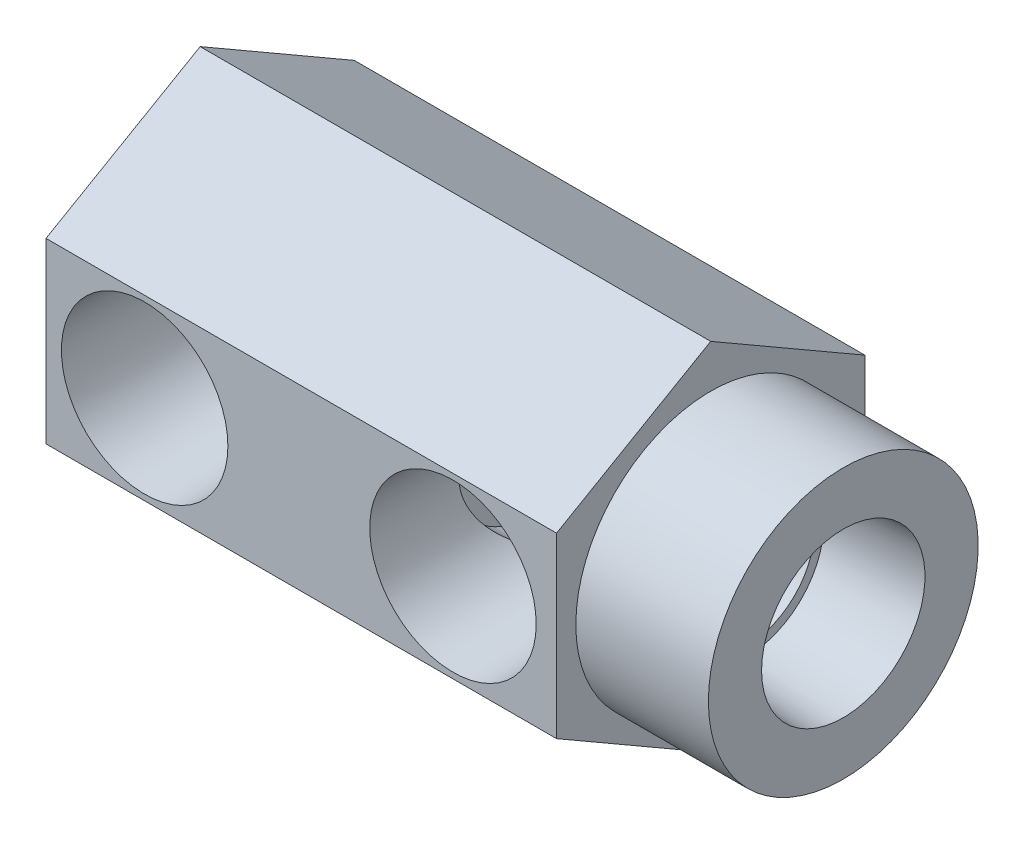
ISO-10303-21;
HEADER;
FILE_DESCRIPTION(('STEP AP214'),'2;1');
FILE_NAME('part.step','',(''),(''),'','','');
FILE_SCHEMA(('AUTOMOTIVE_DESIGN { 1 0 10303 214 1 1 1 1 }'));
ENDSEC;
DATA;
#1=APPLICATION_CONTEXT('core data for automotive mechanical design processes');
#2=APPLICATION_PROTOCOL_DEFINITION('international standard','automotive_design',2000,#1);
#3=PRODUCT_CONTEXT('',#1,'mechanical');
#4=PRODUCT('Part','Part','',(#3));
#5=PRODUCT_RELATED_PRODUCT_CATEGORY('part','',(#4));
#6=PRODUCT_DEFINITION_FORMATION('','',#4);
#7=PRODUCT_DEFINITION_CONTEXT('part definition',#1,'design');
#8=PRODUCT_DEFINITION('design','',#6,#7);
#9=PRODUCT_DEFINITION_SHAPE('','',#8);
#10=(LENGTH_UNIT() NAMED_UNIT(*) SI_UNIT(.MILLI.,.METRE.));
#11=(NAMED_UNIT(*) PLANE_ANGLE_UNIT() SI_UNIT($,.RADIAN.));
#12=(NAMED_UNIT(*) SI_UNIT($,.STERADIAN.) SOLID_ANGLE_UNIT());
#13=UNCERTAINTY_MEASURE_WITH_UNIT(LENGTH_MEASURE(1.E-05),#10,'distance_accuracy_value','');
#14=(GEOMETRIC_REPRESENTATION_CONTEXT(3) GLOBAL_UNCERTAINTY_ASSIGNED_CONTEXT((#13)) GLOBAL_UNIT_ASSIGNED_CONTEXT((#10,
#11,#12)) REPRESENTATION_CONTEXT('',''));
#15=CARTESIAN_POINT('',(0.,0.,0.));
#16=DIRECTION('',(0.,0.,1.));
#17=DIRECTION('',(1.,0.,0.));
#18=AXIS2_PLACEMENT_3D('',#15,#16,#17);
#19=CARTESIAN_POINT('',(52.9844,0.,0.));
#20=DIRECTION('',(1.,0.,0.));
#21=DIRECTION('',(0.,0.,-1.));
#22=AXIS2_PLACEMENT_3D('',#19,#20,#21);
#23=CYLINDRICAL_SURFACE('',#22,3.96875);
#24=CARTESIAN_POINT('',(16.4084,0.,0.));
#25=DIRECTION('',(1.,0.,0.));
#26=DIRECTION('',(0.,0.,-1.));
#27=AXIS2_PLACEMENT_3D('',#24,#25,#26);
#28=CIRCLE('',#27,3.96874999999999);
#29=CARTESIAN_POINT('',(16.4084,0.,-3.96874999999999));
#30=VERTEX_POINT('',#29);
#31=EDGE_CURVE('E168',#30,#30,#28,.T.);
#32=ORIENTED_EDGE('',*,*,#31,.F.);
#33=EDGE_LOOP('',(#32));
#34=FACE_BOUND('',#33,.T.);
#35=CARTESIAN_POINT('',(26.79065,0.,0.));
#36=DIRECTION('',(1.,0.,0.));
#37=DIRECTION('',(0.,0.,-1.));
#38=AXIS2_PLACEMENT_3D('',#35,#36,#37);
#39=CIRCLE('',#38,3.96875);
#40=CARTESIAN_POINT('',(26.79065,0.,-3.96875));
#41=VERTEX_POINT('',#40);
#42=EDGE_CURVE('E39',#41,#41,#39,.F.);
#43=ORIENTED_EDGE('',*,*,#42,.F.);
#44=EDGE_LOOP('',(#43));
#45=FACE_BOUND('',#44,.T.);
#46=ADVANCED_FACE('F35',(#34,#45),#23,.F.);
#47=CARTESIAN_POINT('',(39.0906,0.,2.6797));
#48=DIRECTION('',(0.,0.,-1.));
#49=DIRECTION('',(-1.,0.,0.));
#50=AXIS2_PLACEMENT_3D('',#47,#48,#49);
#51=PLANE('',#50);
#52=DIRECTION('',(-1.,0.,0.));
#53=VECTOR('',#52,1.);
#54=CARTESIAN_POINT('',(0.,4.86010266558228,2.6797));
#55=LINE('',#54,#53);
#56=CARTESIAN_POINT('',(37.9310089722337,4.86010266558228,2.6797));
#57=VERTEX_POINT('',#56);
#58=CARTESIAN_POINT('',(36.2339048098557,4.86010266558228,2.6797));
#59=VERTEX_POINT('',#58);
#60=EDGE_CURVE('E357',#57,#59,#55,.T.);
#61=ORIENTED_EDGE('',*,*,#60,.F.);
#62=CARTESIAN_POINT('',(33.528,0.,2.6797));
#63=DIRECTION('',(0.,0.,1.));
#64=DIRECTION('',(1.,0.,0.));
#65=AXIS2_PLACEMENT_3D('',#62,#63,#64);
#66=CIRCLE('',#65,6.55797879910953);
#67=CARTESIAN_POINT('',(29.1249910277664,4.86010266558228,2.6797));
#68=VERTEX_POINT('',#67);
#69=EDGE_CURVE('E372',#57,#68,#66,.T.);
#70=ORIENTED_EDGE('',*,*,#69,.T.);
#71=CARTESIAN_POINT('',(30.8220951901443,4.86010266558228,2.6797));
#72=VERTEX_POINT('',#71);
#73=EDGE_CURVE('E278',#72,#68,#55,.T.);
#74=ORIENTED_EDGE('',*,*,#73,.F.);
#75=CARTESIAN_POINT('',(33.528,0.,2.6797));
#76=DIRECTION('',(0.,0.,1.));
#77=DIRECTION('',(1.,0.,0.));
#78=AXIS2_PLACEMENT_3D('',#75,#76,#77);
#79=CIRCLE('',#78,5.5626);
#80=EDGE_CURVE('E164',#59,#72,#79,.T.);
#81=ORIENTED_EDGE('',*,*,#80,.F.);
#82=EDGE_LOOP('',(#61,#70,#74,#81));
#83=FACE_BOUND('',#82,.T.);
#84=ADVANCED_FACE('F260',(#83),#51,.F.);
#85=DIRECTION('',(-1.,0.,0.));
#86=VECTOR('',#85,1.);
#87=CARTESIAN_POINT('',(0.,-4.86010266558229,2.6797));
#88=LINE('',#87,#86);
#89=CARTESIAN_POINT('',(29.1249910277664,-4.86010266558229,2.6797));
#90=VERTEX_POINT('',#89);
#91=CARTESIAN_POINT('',(30.8220951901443,-4.86010266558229,2.6797));
#92=VERTEX_POINT('',#91);
#93=EDGE_CURVE('E165',#90,#92,#88,.F.);
#94=ORIENTED_EDGE('',*,*,#93,.F.);
#95=CARTESIAN_POINT('',(37.9310089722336,-4.86010266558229,2.6797));
#96=VERTEX_POINT('',#95);
#97=EDGE_CURVE('E374',#90,#96,#66,.T.);
#98=ORIENTED_EDGE('',*,*,#97,.T.);
#99=CARTESIAN_POINT('',(36.2339048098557,-4.86010266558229,2.6797));
#100=VERTEX_POINT('',#99);
#101=EDGE_CURVE('E320',#100,#96,#88,.F.);
#102=ORIENTED_EDGE('',*,*,#101,.F.);
#103=EDGE_CURVE('E369',#92,#100,#79,.T.);
#104=ORIENTED_EDGE('',*,*,#103,.F.);
#105=EDGE_LOOP('',(#94,#98,#102,#104));
#106=FACE_BOUND('',#105,.T.);
#107=ADVANCED_FACE('F258',(#106),#51,.F.);
#108=CARTESIAN_POINT('',(33.528,0.,12.7));
#109=DIRECTION('',(0.,0.,1.));
#110=DIRECTION('',(1.,0.,0.));
#111=AXIS2_PLACEMENT_3D('',#108,#109,#110);
#112=CONICAL_SURFACE('',#111,6.858,0.0299323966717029);
#113=CARTESIAN_POINT('',(33.528,0.,12.7));
#114=DIRECTION('',(0.,0.,1.));
#115=DIRECTION('',(1.,0.,0.));
#116=AXIS2_PLACEMENT_3D('',#113,#114,#115);
#117=CIRCLE('',#116,6.858);
#118=CARTESIAN_POINT('',(40.386,0.,12.7));
#119=VERTEX_POINT('',#118);
#120=EDGE_CURVE('E377',#119,#119,#117,.T.);
#121=ORIENTED_EDGE('',*,*,#120,.T.);
#122=EDGE_LOOP('',(#121));
#123=FACE_BOUND('',#122,.T.);
#124=CARTESIAN_POINT('',(37.9308783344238,-4.86021293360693,2.6795));
#125=CARTESIAN_POINT('',(37.9796010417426,-4.81909090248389,2.75408000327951));
#126=CARTESIAN_POINT('',(38.0286598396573,-4.77636003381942,2.82753681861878));
#127=CARTESIAN_POINT('',(38.1271327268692,-4.68768621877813,2.97223805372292));
#128=CARTESIAN_POINT('',(38.1765468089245,-4.64174333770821,3.04348251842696));
#129=CARTESIAN_POINT('',(38.3249383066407,-4.4990172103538,3.25407862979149));
#130=CARTESIAN_POINT('',(38.4239764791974,-4.3974102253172,3.39015939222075));
#131=CARTESIAN_POINT('',(38.6208561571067,-4.1803388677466,3.65453950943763));
#132=CARTESIAN_POINT('',(38.7186784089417,-4.06475615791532,3.78275622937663));
#133=CARTESIAN_POINT('',(38.9100637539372,-3.82049762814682,4.029307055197));
#134=CARTESIAN_POINT('',(39.0036289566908,-3.69182839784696,4.14764608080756));
#135=CARTESIAN_POINT('',(39.2343157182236,-3.34676203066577,4.43565665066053));
#136=CARTESIAN_POINT('',(39.3671686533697,-3.12096559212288,4.5978682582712));
#137=CARTESIAN_POINT('',(39.5489763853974,-2.75981236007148,4.81711655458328));
#138=CARTESIAN_POINT('',(39.6066004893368,-2.63586854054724,4.88611027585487));
#139=CARTESIAN_POINT('',(39.7151484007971,-2.38067403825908,5.01539772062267));
#140=CARTESIAN_POINT('',(39.7660734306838,-2.24942469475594,5.07569303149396));
#141=CARTESIAN_POINT('',(39.8520863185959,-2.00333052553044,5.17712379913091));
#142=CARTESIAN_POINT('',(39.8883924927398,-1.88953159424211,5.21977180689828));
#143=CARTESIAN_POINT('',(39.9550956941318,-1.65782803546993,5.29791803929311));
#144=CARTESIAN_POINT('',(39.9854939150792,-1.53992424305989,5.33341770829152));
#145=CARTESIAN_POINT('',(40.0398569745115,-1.30057990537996,5.39677782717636));
#146=CARTESIAN_POINT('',(40.063819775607,-1.17913825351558,5.42463585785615));
#147=CARTESIAN_POINT('',(40.1048268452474,-0.933578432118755,5.47224389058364));
#148=CARTESIAN_POINT('',(40.1218743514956,-0.809461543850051,5.49199768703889));
#149=CARTESIAN_POINT('',(40.1487709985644,-0.55885523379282,5.5231405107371));
#150=CARTESIAN_POINT('',(40.1585888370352,-0.432357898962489,5.53449316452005));
#151=CARTESIAN_POINT('',(40.1706904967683,-0.178520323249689,5.5484842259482));
#152=CARTESIAN_POINT('',(40.172974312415,-0.0511800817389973,5.55112262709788));
#153=CARTESIAN_POINT('',(40.1699567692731,0.203283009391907,5.54763517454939));
#154=CARTESIAN_POINT('',(40.16465579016,0.330405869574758,5.54150975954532));
#155=CARTESIAN_POINT('',(40.1465880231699,0.583395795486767,5.5206114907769));
#156=CARTESIAN_POINT('',(40.1338214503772,0.709262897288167,5.50583888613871));
#157=CARTESIAN_POINT('',(40.1022018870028,0.950343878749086,5.46919361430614));
#158=CARTESIAN_POINT('',(40.0838182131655,1.06570311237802,5.44786787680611));
#159=CARTESIAN_POINT('',(40.0411295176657,1.29381096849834,5.3982490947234));
#160=CARTESIAN_POINT('',(40.0168222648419,1.40655858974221,5.36995342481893));
#161=CARTESIAN_POINT('',(39.9356091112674,1.73984674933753,5.2751807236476));
#162=CARTESIAN_POINT('',(39.8703780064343,1.955681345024,5.19877913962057));
#163=CARTESIAN_POINT('',(39.7466819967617,2.30076549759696,5.05275121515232));
#164=CARTESIAN_POINT('',(39.6933328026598,2.43470156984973,4.98950366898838));
#165=CARTESIAN_POINT('',(39.5797013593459,2.6948493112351,4.85393413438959));
#166=CARTESIAN_POINT('',(39.519417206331,2.821058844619,4.78160965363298));
#167=CARTESIAN_POINT('',(39.3293668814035,3.1883592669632,4.55185021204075));
#168=CARTESIAN_POINT('',(39.1907125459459,3.4172894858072,4.38199026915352));
#169=CARTESIAN_POINT('',(38.9573299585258,3.75614165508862,4.08913434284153));
#170=CARTESIAN_POINT('',(38.8672558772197,3.8769998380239,3.97462339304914));
#171=CARTESIAN_POINT('',(38.6834858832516,4.10679298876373,3.7367067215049));
#172=CARTESIAN_POINT('',(38.5897886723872,4.2157236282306,3.61329779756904));
#173=CARTESIAN_POINT('',(38.4015163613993,4.42068084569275,3.35936882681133));
#174=CARTESIAN_POINT('',(38.3069577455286,4.51681890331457,3.22892636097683));
#175=CARTESIAN_POINT('',(38.1653363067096,4.65221359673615,3.02734860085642));
#176=CARTESIAN_POINT('',(38.1181809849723,4.69586329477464,2.95919413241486));
#177=CARTESIAN_POINT('',(38.024207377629,4.78023530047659,2.82086775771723));
#178=CARTESIAN_POINT('',(37.9773891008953,4.82095753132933,2.75069579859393));
#179=CARTESIAN_POINT('',(37.9308783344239,4.86021293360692,2.6795));
#180=B_SPLINE_CURVE_WITH_KNOTS('',3,(#124,#125,#126,#127,#128,#129,#130,#131,#132,#133,#134,
#135,#136,#137,#138,#139,#140,#141,#142,#143,#144,#145,#146,#147,#148,#149,#150,#151,#152,#153,
#154,#155,#156,#157,#158,#159,#160,#161,#162,#163,#164,#165,#166,#167,#168,#169,#170,#171,#172,
#173,#174,#175,#176,#177,#178,#179),.UNSPECIFIED.,.F.,.F.,(4,2,2,2,2,2,2,2,2,2,2,2,2,2,2,2,2,2,
2,2,2,2,2,2,2,2,2,4),(0.,0.294309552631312,0.588613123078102,1.17774797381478,1.77227581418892,
2.36650575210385,3.28677118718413,3.74565786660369,4.20446069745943,4.58459599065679,
4.96465439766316,5.34483298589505,5.72483337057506,6.10646952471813,6.48810596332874,
6.86972329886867,7.25132964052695,7.60716212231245,7.96312883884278,8.67430841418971,
9.14605597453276,9.61793335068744,10.5645286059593,11.1319225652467,11.6995217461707,
12.2617956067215,12.5427445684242,12.8237008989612),.UNSPECIFIED.);
#181=EDGE_CURVE('E264',#96,#57,#180,.T.);
#182=ORIENTED_EDGE('',*,*,#181,.F.);
#183=ORIENTED_EDGE('',*,*,#97,.F.);
#184=CARTESIAN_POINT('',(29.1251216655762,4.86021293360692,2.6795));
#185=CARTESIAN_POINT('',(29.0763989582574,4.81909090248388,2.75408000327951));
#186=CARTESIAN_POINT('',(29.0273401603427,4.77636003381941,2.82753681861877));
#187=CARTESIAN_POINT('',(28.9288672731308,4.68768621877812,2.97223805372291));
#188=CARTESIAN_POINT('',(28.8794531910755,4.64174333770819,3.04348251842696));
#189=CARTESIAN_POINT('',(28.7310616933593,4.49901721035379,3.25407862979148));
#190=CARTESIAN_POINT('',(28.6320235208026,4.39741022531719,3.39015939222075));
#191=CARTESIAN_POINT('',(28.4351438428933,4.18033886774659,3.65453950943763));
#192=CARTESIAN_POINT('',(28.3373215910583,4.0647561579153,3.78275622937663));
#193=CARTESIAN_POINT('',(28.1459362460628,3.82049762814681,4.029307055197));
#194=CARTESIAN_POINT('',(28.0523710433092,3.69182839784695,4.14764608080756));
#195=CARTESIAN_POINT('',(27.8216842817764,3.34676203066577,4.43565665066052));
#196=CARTESIAN_POINT('',(27.6888313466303,3.12096559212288,4.5978682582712));
#197=CARTESIAN_POINT('',(27.5070236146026,2.75981236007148,4.81711655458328));
#198=CARTESIAN_POINT('',(27.4493995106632,2.63586854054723,4.88611027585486));
#199=CARTESIAN_POINT('',(27.3408515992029,2.38067403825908,5.01539772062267));
#200=CARTESIAN_POINT('',(27.2899265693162,2.24942469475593,5.07569303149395));
#201=CARTESIAN_POINT('',(27.2039136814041,2.00333052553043,5.17712379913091));
#202=CARTESIAN_POINT('',(27.1676075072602,1.8895315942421,5.21977180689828));
#203=CARTESIAN_POINT('',(27.1009043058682,1.65782803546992,5.29791803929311));
#204=CARTESIAN_POINT('',(27.0705060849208,1.53992424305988,5.33341770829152));
#205=CARTESIAN_POINT('',(27.0161430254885,1.30057990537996,5.39677782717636));
#206=CARTESIAN_POINT('',(26.992180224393,1.17913825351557,5.42463585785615));
#207=CARTESIAN_POINT('',(26.9511731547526,0.933578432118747,5.47224389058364));
#208=CARTESIAN_POINT('',(26.9341256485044,0.809461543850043,5.49199768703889));
#209=CARTESIAN_POINT('',(26.9072290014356,0.558855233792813,5.52314051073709));
#210=CARTESIAN_POINT('',(26.8974111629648,0.432357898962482,5.53449316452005));
#211=CARTESIAN_POINT('',(26.8853095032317,0.178520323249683,5.5484842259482));
#212=CARTESIAN_POINT('',(26.883025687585,0.0511800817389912,5.55112262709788));
#213=CARTESIAN_POINT('',(26.8860432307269,-0.203283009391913,5.54763517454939));
#214=CARTESIAN_POINT('',(26.89134420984,-0.330405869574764,5.54150975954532));
#215=CARTESIAN_POINT('',(26.9094119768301,-0.583395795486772,5.5206114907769));
#216=CARTESIAN_POINT('',(26.9221785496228,-0.709262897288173,5.50583888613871));
#217=CARTESIAN_POINT('',(26.9537981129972,-0.950343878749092,5.46919361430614));
#218=CARTESIAN_POINT('',(26.9721817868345,-1.06570311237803,5.44786787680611));
#219=CARTESIAN_POINT('',(27.0148704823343,-1.29381096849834,5.39824909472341));
#220=CARTESIAN_POINT('',(27.0391777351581,-1.40655858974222,5.36995342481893));
#221=CARTESIAN_POINT('',(27.1203908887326,-1.73984674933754,5.2751807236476));
#222=CARTESIAN_POINT('',(27.1856219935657,-1.95568134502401,5.19877913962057));
#223=CARTESIAN_POINT('',(27.3093180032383,-2.30076549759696,5.05275121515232));
#224=CARTESIAN_POINT('',(27.3626671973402,-2.43470156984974,4.98950366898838));
#225=CARTESIAN_POINT('',(27.4762986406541,-2.69484931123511,4.85393413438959));
#226=CARTESIAN_POINT('',(27.536582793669,-2.82105884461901,4.78160965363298));
#227=CARTESIAN_POINT('',(27.7266331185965,-3.18835926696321,4.55185021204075));
#228=CARTESIAN_POINT('',(27.8652874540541,-3.41728948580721,4.38199026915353));
#229=CARTESIAN_POINT('',(28.0986700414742,-3.75614165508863,4.08913434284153));
#230=CARTESIAN_POINT('',(28.1887441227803,-3.87699983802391,3.97462339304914));
#231=CARTESIAN_POINT('',(28.3725141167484,-4.10679298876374,3.7367067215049));
#232=CARTESIAN_POINT('',(28.4662113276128,-4.21572362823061,3.61329779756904));
#233=CARTESIAN_POINT('',(28.6544836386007,-4.42068084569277,3.35936882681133));
#234=CARTESIAN_POINT('',(28.7490422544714,-4.51681890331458,3.22892636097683));
#235=CARTESIAN_POINT('',(28.8906636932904,-4.65221359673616,3.02734860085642));
#236=CARTESIAN_POINT('',(28.9378190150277,-4.69586329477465,2.95919413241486));
#237=CARTESIAN_POINT('',(29.031792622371,-4.7802353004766,2.82086775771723));
#238=CARTESIAN_POINT('',(29.0786108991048,-4.82095753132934,2.75069579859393));
#239=CARTESIAN_POINT('',(29.1251216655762,-4.86021293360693,2.6795));
#240=B_SPLINE_CURVE_WITH_KNOTS('',3,(#184,#185,#186,#187,#188,#189,#190,#191,#192,#193,#194,
#195,#196,#197,#198,#199,#200,#201,#202,#203,#204,#205,#206,#207,#208,#209,#210,#211,#212,#213,
#214,#215,#216,#217,#218,#219,#220,#221,#222,#223,#224,#225,#226,#227,#228,#229,#230,#231,#232,
#233,#234,#235,#236,#237,#238,#239),.UNSPECIFIED.,.F.,.F.,(4,2,2,2,2,2,2,2,2,2,2,2,2,2,2,2,2,2,
2,2,2,2,2,2,2,2,2,4),(0.,0.294309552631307,0.588613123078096,1.17774797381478,1.77227581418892,
2.36650575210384,3.28677118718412,3.74565786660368,4.20446069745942,4.58459599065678,
4.96465439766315,5.34483298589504,5.72483337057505,6.10646952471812,6.48810596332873,
6.86972329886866,7.25132964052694,7.60716212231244,7.96312883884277,8.6743084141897,
9.14605597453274,9.61793335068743,10.5645286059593,11.1319225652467,11.6995217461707,
12.2617956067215,12.5427445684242,12.8237008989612),.UNSPECIFIED.);
#241=EDGE_CURVE('E272',#68,#90,#240,.T.);
#242=ORIENTED_EDGE('',*,*,#241,.F.);
#243=ORIENTED_EDGE('',*,*,#69,.F.);
#244=EDGE_LOOP('',(#182,#183,#242,#243));
#245=FACE_BOUND('',#244,.T.);
#246=ADVANCED_FACE('F254',(#123,#245),#112,.F.);
#247=CARTESIAN_POINT('',(33.528,0.,12.7));
#248=DIRECTION('',(0.,0.,1.));
#249=DIRECTION('',(1.,0.,0.));
#250=AXIS2_PLACEMENT_3D('',#247,#248,#249);
#251=CYLINDRICAL_SURFACE('',#250,5.56260000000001);
#252=CARTESIAN_POINT('',(29.1430778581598,3.42271479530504,-4.3688));
#253=CARTESIAN_POINT('',(29.2053786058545,3.50252392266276,-4.30626922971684));
#254=CARTESIAN_POINT('',(29.2692305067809,3.57983993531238,-4.24217199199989));
#255=CARTESIAN_POINT('',(29.3997001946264,3.72954742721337,-4.111175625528));
#256=CARTESIAN_POINT('',(29.4663169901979,3.80194064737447,-4.0442775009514));
#257=CARTESIAN_POINT('',(29.6696020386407,4.01162562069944,-3.84008739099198));
#258=CARTESIAN_POINT('',(29.8099614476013,4.14174719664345,-3.69904228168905));
#259=CARTESIAN_POINT('',(30.0975597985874,4.38288342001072,-3.40984184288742));
#260=CARTESIAN_POINT('',(30.2447640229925,4.4939834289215,-3.26172230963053));
#261=CARTESIAN_POINT('',(30.5450099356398,4.69864874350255,-2.95929639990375));
#262=CARTESIAN_POINT('',(30.6980539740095,4.79220689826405,-2.80498753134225));
#263=CARTESIAN_POINT('',(30.9831508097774,4.94855700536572,-2.51703491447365));
#264=CARTESIAN_POINT('',(31.1145644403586,5.01387804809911,-2.38411695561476));
#265=CARTESIAN_POINT('',(31.3796036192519,5.13303105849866,-2.11541586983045));
#266=CARTESIAN_POINT('',(31.5132288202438,5.1868648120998,-1.97963319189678));
#267=CARTESIAN_POINT('',(31.7816711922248,5.28329287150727,-1.7056562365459));
#268=CARTESIAN_POINT('',(31.9164866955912,5.32590091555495,-1.56746512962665));
#269=CARTESIAN_POINT('',(32.1863893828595,5.40019502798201,-1.28848056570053));
#270=CARTESIAN_POINT('',(32.3214764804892,5.43188413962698,-1.14768784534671));
#271=CARTESIAN_POINT('',(32.5189904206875,5.47070908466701,-0.936746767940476));
#272=CARTESIAN_POINT('',(32.5823943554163,5.48200911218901,-0.868244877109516));
#273=CARTESIAN_POINT('',(32.7080219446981,5.50219723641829,-0.729494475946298));
#274=CARTESIAN_POINT('',(32.7702429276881,5.51108036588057,-0.659242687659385));
#275=CARTESIAN_POINT('',(32.878517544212,5.5247658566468,-0.530668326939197));
#276=CARTESIAN_POINT('',(32.9252277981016,5.53003323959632,-0.4729291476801));
#277=CARTESIAN_POINT('',(33.0138391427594,5.53895660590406,-0.353523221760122));
#278=CARTESIAN_POINT('',(33.0557550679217,5.54261766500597,-0.291869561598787));
#279=CARTESIAN_POINT('',(33.1029068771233,5.54635110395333,-0.200071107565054));
#280=CARTESIAN_POINT('',(33.1149282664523,5.54725075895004,-0.17362424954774));
#281=CARTESIAN_POINT('',(33.1346806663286,5.54868581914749,-0.11920938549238));
#282=CARTESIAN_POINT('',(33.1424339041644,5.54922311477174,-0.091250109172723));
#283=CARTESIAN_POINT('',(33.1507682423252,5.54979551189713,-0.0406082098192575));
#284=CARTESIAN_POINT('',(33.1525611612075,5.54991574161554,-0.0181354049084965));
#285=CARTESIAN_POINT('',(33.1520473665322,5.5498809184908,0.0267461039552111));
#286=CARTESIAN_POINT('',(33.1497432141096,5.54972603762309,0.0491548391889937));
#287=CARTESIAN_POINT('',(33.1402182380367,5.54906942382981,0.100345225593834));
#288=CARTESIAN_POINT('',(33.1316568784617,5.54847233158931,0.128864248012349));
#289=CARTESIAN_POINT('',(33.1103226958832,5.54690714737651,0.184367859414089));
#290=CARTESIAN_POINT('',(33.0975213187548,5.54593653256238,0.21134054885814));
#291=CARTESIAN_POINT('',(33.0586644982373,5.54281975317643,0.284099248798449));
#292=CARTESIAN_POINT('',(33.0299816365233,5.5403433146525,0.328420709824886));
#293=CARTESIAN_POINT('',(32.9692649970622,5.5345538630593,0.414689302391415));
#294=CARTESIAN_POINT('',(32.9372207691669,5.53123819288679,0.456628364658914));
#295=CARTESIAN_POINT('',(32.8710999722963,5.52377748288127,0.539458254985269));
#296=CARTESIAN_POINT('',(32.8370069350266,5.51962483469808,0.580335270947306));
#297=CARTESIAN_POINT('',(32.7679056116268,5.51053473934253,0.661091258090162));
#298=CARTESIAN_POINT('',(32.7328988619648,5.50559854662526,0.700971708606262));
#299=CARTESIAN_POINT('',(32.6194514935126,5.48846855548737,0.828218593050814));
#300=CARTESIAN_POINT('',(32.5399173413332,5.47474378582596,0.914407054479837));
#301=CARTESIAN_POINT('',(32.3799423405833,5.44345110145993,1.08523802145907));
#302=CARTESIAN_POINT('',(32.2995012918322,5.42588232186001,1.16988017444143));
#303=CARTESIAN_POINT('',(32.0576616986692,5.36731988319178,1.4223942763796));
#304=CARTESIAN_POINT('',(31.8959389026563,5.32049832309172,1.58864694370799));
#305=CARTESIAN_POINT('',(31.5803741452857,5.21306486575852,1.9113037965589));
#306=CARTESIAN_POINT('',(31.4264669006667,5.15304719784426,2.06784173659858));
#307=CARTESIAN_POINT('',(31.1978738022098,5.05172859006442,2.29968019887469));
#308=CARTESIAN_POINT('',(31.1221017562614,5.01610006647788,2.37641685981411));
#309=CARTESIAN_POINT('',(30.9714170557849,4.94100069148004,2.52885627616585));
#310=CARTESIAN_POINT('',(30.89650445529,4.90152959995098,2.60455896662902));
#311=CARTESIAN_POINT('',(30.8220951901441,4.8601026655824,2.67969999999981));
#312=B_SPLINE_CURVE_WITH_KNOTS('',3,(#252,#253,#254,#255,#256,#257,#258,#259,#260,#261,#262,
#263,#264,#265,#266,#267,#268,#269,#270,#271,#272,#273,#274,#275,#276,#277,#278,#279,#280,#281,
#282,#283,#284,#285,#286,#287,#288,#289,#290,#291,#292,#293,#294,#295,#296,#297,#298,#299,#300,
#301,#302,#303,#304,#305,#306,#307,#308,#309,#310,#311),.UNSPECIFIED.,.F.,.F.,(4,2,2,2,2,2,2,2,
2,2,2,2,2,2,2,2,2,2,2,2,2,2,2,2,2,2,2,2,2,4),(0.,0.356890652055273,0.713654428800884,
1.42572741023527,2.13451598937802,2.84359287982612,3.4372250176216,4.03076479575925,
4.6235747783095,5.2162194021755,5.49827347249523,5.78090291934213,6.00433449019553,
6.22705487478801,6.3140330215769,6.40055381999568,6.46782718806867,6.53505851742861,
6.62386536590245,6.71328286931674,6.87138898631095,7.03000208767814,7.19012792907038,
7.34999994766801,7.70411945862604,8.05831872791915,8.7675669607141,9.44975807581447,
9.7904185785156,10.1311003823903),.UNSPECIFIED.);
#313=CARTESIAN_POINT('',(29.1430778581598,3.42271479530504,-4.3688));
#314=VERTEX_POINT('',#313);
#315=EDGE_CURVE('E150',#314,#72,#312,.T.);
#316=ORIENTED_EDGE('',*,*,#315,.F.);
#317=CARTESIAN_POINT('',(33.528,0.,-4.3688));
#318=DIRECTION('',(0.,0.,1.));
#319=DIRECTION('',(1.,0.,0.));
#320=AXIS2_PLACEMENT_3D('',#317,#318,#319);
#321=CIRCLE('',#320,5.56260000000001);
#322=CARTESIAN_POINT('',(37.9129221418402,3.42271479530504,-4.3688));
#323=VERTEX_POINT('',#322);
#324=EDGE_CURVE('E162',#323,#314,#321,.T.);
#325=ORIENTED_EDGE('',*,*,#324,.F.);
#326=CARTESIAN_POINT('',(36.2339048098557,4.86010266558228,2.6797));
#327=CARTESIAN_POINT('',(36.1573626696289,4.90271691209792,2.6024048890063));
#328=CARTESIAN_POINT('',(36.0802883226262,4.94326160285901,2.52451611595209));
#329=CARTESIAN_POINT('',(35.9252343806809,5.02028696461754,2.36764700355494));
#330=CARTESIAN_POINT('',(35.8472548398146,5.05676787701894,2.28866672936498));
#331=CARTESIAN_POINT('',(35.6120714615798,5.16028405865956,2.05010484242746));
#332=CARTESIAN_POINT('',(35.4537326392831,5.22133212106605,1.88901283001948));
#333=CARTESIAN_POINT('',(35.1345730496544,5.32821249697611,1.56246076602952));
#334=CARTESIAN_POINT('',(34.9737434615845,5.37396013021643,1.39698170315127));
#335=CARTESIAN_POINT('',(34.7333316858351,5.43106765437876,1.14553430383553));
#336=CARTESIAN_POINT('',(34.6533574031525,5.44818105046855,1.06120651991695));
#337=CARTESIAN_POINT('',(34.4943992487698,5.47860389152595,0.890954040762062));
#338=CARTESIAN_POINT('',(34.4154151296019,5.49191430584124,0.805029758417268));
#339=CARTESIAN_POINT('',(34.2931936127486,5.50990529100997,0.667021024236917));
#340=CARTESIAN_POINT('',(34.2489571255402,5.51585557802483,0.615983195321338));
#341=CARTESIAN_POINT('',(34.1624383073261,5.52647109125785,0.512104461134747));
#342=CARTESIAN_POINT('',(34.1201555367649,5.5311366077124,0.459263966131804));
#343=CARTESIAN_POINT('',(34.0564332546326,5.53749527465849,0.372271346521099));
#344=CARTESIAN_POINT('',(34.033506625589,5.53962582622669,0.339251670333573));
#345=CARTESIAN_POINT('',(33.9905937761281,5.5433727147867,0.271242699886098));
#346=CARTESIAN_POINT('',(33.9706061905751,5.54498929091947,0.236254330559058));
#347=CARTESIAN_POINT('',(33.9426831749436,5.54713245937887,0.176754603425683));
#348=CARTESIAN_POINT('',(33.933013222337,5.54784146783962,0.153090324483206));
#349=CARTESIAN_POINT('',(33.9172951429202,5.54896659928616,0.104612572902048));
#350=CARTESIAN_POINT('',(33.9112335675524,5.54938381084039,0.0798037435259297));
#351=CARTESIAN_POINT('',(33.9039509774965,5.54988255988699,0.0290359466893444));
#352=CARTESIAN_POINT('',(33.9028053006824,5.54995887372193,0.00306520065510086));
#353=CARTESIAN_POINT('',(33.9059120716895,5.54974795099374,-0.0485454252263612));
#354=CARTESIAN_POINT('',(33.9101699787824,5.54946034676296,-0.0741849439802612));
#355=CARTESIAN_POINT('',(33.9247955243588,5.54843534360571,-0.131549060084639));
#356=CARTESIAN_POINT('',(33.9365743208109,5.54759189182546,-0.162888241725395));
#357=CARTESIAN_POINT('',(33.9643836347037,5.54547446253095,-0.223685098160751));
#358=CARTESIAN_POINT('',(33.9804398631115,5.54419786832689,-0.253130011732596));
#359=CARTESIAN_POINT('',(34.0343579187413,5.53962508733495,-0.343123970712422));
#360=CARTESIAN_POINT('',(34.0763107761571,5.5356796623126,-0.401107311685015));
#361=CARTESIAN_POINT('',(34.1638595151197,5.52631907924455,-0.514176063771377));
#362=CARTESIAN_POINT('',(34.2094670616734,5.52089907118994,-0.569251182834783));
#363=CARTESIAN_POINT('',(34.3026304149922,5.50860024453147,-0.678027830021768));
#364=CARTESIAN_POINT('',(34.350194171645,5.50171487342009,-0.731721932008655));
#365=CARTESIAN_POINT('',(34.4461025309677,5.48652622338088,-0.838028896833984));
#366=CARTESIAN_POINT('',(34.4944457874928,5.47822519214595,-0.890643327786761));
#367=CARTESIAN_POINT('',(34.6402922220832,5.45115530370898,-1.047668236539));
#368=CARTESIAN_POINT('',(34.7384665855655,5.43023844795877,-1.15109678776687));
#369=CARTESIAN_POINT('',(34.9351156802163,5.38263989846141,-1.35633654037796));
#370=CARTESIAN_POINT('',(35.0335904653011,5.35595710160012,-1.45814742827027));
#371=CARTESIAN_POINT('',(35.3287530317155,5.26707075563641,-1.76179770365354));
#372=CARTESIAN_POINT('',(35.5249600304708,5.19606887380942,-1.96162494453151));
#373=CARTESIAN_POINT('',(35.9119743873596,5.03024468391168,-2.35440015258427));
#374=CARTESIAN_POINT('',(36.1028039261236,4.935543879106,-2.54737764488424));
#375=CARTESIAN_POINT('',(36.4776329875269,4.7210948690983,-2.92572825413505));
#376=CARTESIAN_POINT('',(36.6616385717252,4.60136955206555,-3.11110813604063));
#377=CARTESIAN_POINT('',(36.9369676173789,4.39724605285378,-3.38822135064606));
#378=CARTESIAN_POINT('',(37.0317095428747,4.32220369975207,-3.48352487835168));
#379=CARTESIAN_POINT('',(37.2179314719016,4.16435060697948,-3.67077145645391));
#380=CARTESIAN_POINT('',(37.3094126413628,4.08154268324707,-3.76271570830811));
#381=CARTESIAN_POINT('',(37.4889086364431,3.90760849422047,-3.94306288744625));
#382=CARTESIAN_POINT('',(37.5769089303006,3.81645174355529,-4.03145099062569));
#383=CARTESIAN_POINT('',(37.748455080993,3.62583915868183,-4.20370936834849));
#384=CARTESIAN_POINT('',(37.8319969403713,3.52637607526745,-4.28757558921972));
#385=CARTESIAN_POINT('',(37.9129221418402,3.42271479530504,-4.3688));
#386=B_SPLINE_CURVE_WITH_KNOTS('',3,(#326,#327,#328,#329,#330,#331,#332,#333,#334,#335,#336,
#337,#338,#339,#340,#341,#342,#343,#344,#345,#346,#347,#348,#349,#350,#351,#352,#353,#354,#355,
#356,#357,#358,#359,#360,#361,#362,#363,#364,#365,#366,#367,#368,#369,#370,#371,#372,#373,#374,
#375,#376,#377,#378,#379,#380,#381,#382,#383,#384,#385),.UNSPECIFIED.,.F.,.F.,(4,2,2,2,2,2,2,2,
2,2,2,2,2,2,2,2,2,2,2,2,2,2,2,2,2,2,2,2,2,4),(0.,0.350444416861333,0.700868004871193,
1.4022157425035,2.10738322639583,2.45975259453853,2.8120320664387,3.01541959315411,
3.21876113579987,3.33946287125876,3.46010836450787,3.53663938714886,3.61288336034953,
3.69029171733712,3.7677783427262,3.86768133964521,3.96819894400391,4.18262718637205,
4.39776940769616,4.61389466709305,4.82967991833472,5.26190889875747,5.69422064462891,
6.55980087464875,7.42103111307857,8.28147706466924,8.74300288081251,9.20436198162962,
9.66747853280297,10.1310035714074),.UNSPECIFIED.);
#387=EDGE_CURVE('E58',#59,#323,#386,.T.);
#388=ORIENTED_EDGE('',*,*,#387,.F.);
#389=ORIENTED_EDGE('',*,*,#80,.T.);
#390=EDGE_LOOP('',(#316,#325,#388,#389));
#391=FACE_BOUND('',#390,.T.);
#392=ADVANCED_FACE('F161',(#391),#251,.F.);
#393=CARTESIAN_POINT('',(37.9129221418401,-3.42271479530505,-4.3688));
#394=CARTESIAN_POINT('',(37.8506213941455,-3.50252392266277,-4.30626922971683));
#395=CARTESIAN_POINT('',(37.7867694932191,-3.57983993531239,-4.24217199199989));
#396=CARTESIAN_POINT('',(37.6562998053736,-3.72954742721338,-4.111175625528));
#397=CARTESIAN_POINT('',(37.5896830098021,-3.80194064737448,-4.0442775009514));
#398=CARTESIAN_POINT('',(37.3863979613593,-4.01162562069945,-3.84008739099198));
#399=CARTESIAN_POINT('',(37.2460385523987,-4.14174719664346,-3.69904228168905));
#400=CARTESIAN_POINT('',(36.9584402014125,-4.38288342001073,-3.40984184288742));
#401=CARTESIAN_POINT('',(36.8112359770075,-4.49398342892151,-3.26172230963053));
#402=CARTESIAN_POINT('',(36.5109900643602,-4.69864874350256,-2.95929639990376));
#403=CARTESIAN_POINT('',(36.3579460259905,-4.79220689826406,-2.80498753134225));
#404=CARTESIAN_POINT('',(36.0728491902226,-4.94855700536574,-2.51703491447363));
#405=CARTESIAN_POINT('',(35.9414355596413,-5.01387804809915,-2.38411695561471));
#406=CARTESIAN_POINT('',(35.676396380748,-5.13303105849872,-2.11541586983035));
#407=CARTESIAN_POINT('',(35.5427711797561,-5.18686481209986,-1.97963319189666));
#408=CARTESIAN_POINT('',(35.274328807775,-5.28329287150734,-1.70565623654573));
#409=CARTESIAN_POINT('',(35.1395133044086,-5.32590091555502,-1.56746512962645));
#410=CARTESIAN_POINT('',(34.8696106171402,-5.40019502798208,-1.28848056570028));
#411=CARTESIAN_POINT('',(34.7345235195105,-5.43188413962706,-1.14768784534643));
#412=CARTESIAN_POINT('',(34.5370095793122,-5.47070908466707,-0.936746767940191));
#413=CARTESIAN_POINT('',(34.4736056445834,-5.48200911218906,-0.868244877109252));
#414=CARTESIAN_POINT('',(34.3479780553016,-5.50219723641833,-0.729494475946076));
#415=CARTESIAN_POINT('',(34.2857570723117,-5.51108036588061,-0.659242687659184));
#416=CARTESIAN_POINT('',(34.1774824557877,-5.52476585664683,-0.530668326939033));
#417=CARTESIAN_POINT('',(34.1307722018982,-5.53003323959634,-0.472929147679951));
#418=CARTESIAN_POINT('',(34.0421608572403,-5.53895660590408,-0.353523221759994));
#419=CARTESIAN_POINT('',(34.0002449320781,-5.54261766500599,-0.291869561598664));
#420=CARTESIAN_POINT('',(33.9530931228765,-5.54635110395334,-0.200071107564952));
#421=CARTESIAN_POINT('',(33.9410717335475,-5.54725075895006,-0.173624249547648));
#422=CARTESIAN_POINT('',(33.9213193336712,-5.5486858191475,-0.119209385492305));
#423=CARTESIAN_POINT('',(33.9135660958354,-5.54922311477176,-0.0912501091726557));
#424=CARTESIAN_POINT('',(33.9052317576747,-5.54979551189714,-0.040608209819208));
#425=CARTESIAN_POINT('',(33.9034388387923,-5.54991574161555,-0.0181354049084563));
#426=CARTESIAN_POINT('',(33.9039526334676,-5.54988091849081,0.0267461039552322));
#427=CARTESIAN_POINT('',(33.9062567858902,-5.5497260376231,0.049154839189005));
#428=CARTESIAN_POINT('',(33.9157817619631,-5.54906942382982,0.100345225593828));
#429=CARTESIAN_POINT('',(33.9243431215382,-5.54847233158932,0.128864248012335));
#430=CARTESIAN_POINT('',(33.9456773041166,-5.54690714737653,0.184367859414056));
#431=CARTESIAN_POINT('',(33.9584786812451,-5.54593653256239,0.211340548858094));
#432=CARTESIAN_POINT('',(33.9973355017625,-5.54281975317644,0.284099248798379));
#433=CARTESIAN_POINT('',(34.0260183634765,-5.54034331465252,0.328420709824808));
#434=CARTESIAN_POINT('',(34.0867350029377,-5.53455386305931,0.414689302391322));
#435=CARTESIAN_POINT('',(34.1187792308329,-5.53123819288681,0.456628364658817));
#436=CARTESIAN_POINT('',(34.1849000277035,-5.5237774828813,0.539458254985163));
#437=CARTESIAN_POINT('',(34.2189930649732,-5.5196248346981,0.580335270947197));
#438=CARTESIAN_POINT('',(34.288094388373,-5.51053473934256,0.66109125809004));
#439=CARTESIAN_POINT('',(34.323101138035,-5.50559854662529,0.700971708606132));
#440=CARTESIAN_POINT('',(34.4365485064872,-5.4884685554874,0.828218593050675));
#441=CARTESIAN_POINT('',(34.5160826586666,-5.474743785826,0.914407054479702));
#442=CARTESIAN_POINT('',(34.6760576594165,-5.44345110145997,1.08523802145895));
#443=CARTESIAN_POINT('',(34.7564987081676,-5.42588232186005,1.16988017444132));
#444=CARTESIAN_POINT('',(34.9983383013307,-5.36731988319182,1.4223942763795));
#445=CARTESIAN_POINT('',(35.1600610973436,-5.32049832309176,1.58864694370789));
#446=CARTESIAN_POINT('',(35.4756258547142,-5.21306486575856,1.91130379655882));
#447=CARTESIAN_POINT('',(35.6295330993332,-5.1530471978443,2.06784173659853));
#448=CARTESIAN_POINT('',(35.8581261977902,-5.05172859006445,2.29968019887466));
#449=CARTESIAN_POINT('',(35.9338982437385,-5.0161000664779,2.37641685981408));
#450=CARTESIAN_POINT('',(36.084582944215,-4.94100069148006,2.52885627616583));
#451=CARTESIAN_POINT('',(36.1594955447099,-4.901529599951,2.60455896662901));
#452=CARTESIAN_POINT('',(36.2339048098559,-4.86010266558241,2.67969999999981));
#453=B_SPLINE_CURVE_WITH_KNOTS('',3,(#393,#394,#395,#396,#397,#398,#399,#400,#401,#402,#403,
#404,#405,#406,#407,#408,#409,#410,#411,#412,#413,#414,#415,#416,#417,#418,#419,#420,#421,#422,
#423,#424,#425,#426,#427,#428,#429,#430,#431,#432,#433,#434,#435,#436,#437,#438,#439,#440,#441,
#442,#443,#444,#445,#446,#447,#448,#449,#450,#451,#452),.UNSPECIFIED.,.F.,.F.,(4,2,2,2,2,2,2,2,
2,2,2,2,2,2,2,2,2,2,2,2,2,2,2,2,2,2,2,2,2,4),(0.,0.356890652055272,0.713654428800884,
1.42572741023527,2.13451598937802,2.84359287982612,3.43722501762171,4.03076479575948,
4.62357477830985,5.21621940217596,5.49827347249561,5.78090291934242,6.00433449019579,
6.22705487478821,6.31403302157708,6.40055381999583,6.4678271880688,6.53505851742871,
6.62386536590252,6.71328286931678,6.87138898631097,7.03000208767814,7.19012792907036,
7.34999994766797,7.70411945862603,8.05831872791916,8.76756696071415,9.44975807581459,
9.79041857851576,10.1311003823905),.UNSPECIFIED.);
#454=CARTESIAN_POINT('',(37.9129221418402,-3.42271479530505,-4.3688));
#455=VERTEX_POINT('',#454);
#456=EDGE_CURVE('E316',#455,#100,#453,.T.);
#457=ORIENTED_EDGE('',*,*,#456,.F.);
#458=CARTESIAN_POINT('',(29.1430778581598,-3.42271479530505,-4.3688));
#459=VERTEX_POINT('',#458);
#460=EDGE_CURVE('E169',#459,#455,#321,.T.);
#461=ORIENTED_EDGE('',*,*,#460,.F.);
#462=CARTESIAN_POINT('',(30.8220951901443,-4.86010266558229,2.6797));
#463=CARTESIAN_POINT('',(30.8986373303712,-4.90271691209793,2.6024048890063));
#464=CARTESIAN_POINT('',(30.9757116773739,-4.94326160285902,2.52451611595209));
#465=CARTESIAN_POINT('',(31.1307656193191,-5.02028696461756,2.36764700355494));
#466=CARTESIAN_POINT('',(31.2087451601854,-5.05676787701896,2.28866672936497));
#467=CARTESIAN_POINT('',(31.4439285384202,-5.16028405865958,2.05010484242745));
#468=CARTESIAN_POINT('',(31.6022673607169,-5.22133212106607,1.88901283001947));
#469=CARTESIAN_POINT('',(31.9214269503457,-5.32821249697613,1.56246076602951));
#470=CARTESIAN_POINT('',(32.0822565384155,-5.37396013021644,1.39698170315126));
#471=CARTESIAN_POINT('',(32.3226683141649,-5.43106765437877,1.14553430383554));
#472=CARTESIAN_POINT('',(32.4026425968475,-5.44818105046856,1.06120651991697));
#473=CARTESIAN_POINT('',(32.5616007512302,-5.47860389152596,0.890954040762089));
#474=CARTESIAN_POINT('',(32.6405848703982,-5.49191430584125,0.805029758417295));
#475=CARTESIAN_POINT('',(32.7628063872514,-5.50990529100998,0.667021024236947));
#476=CARTESIAN_POINT('',(32.8070428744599,-5.51585557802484,0.615983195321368));
#477=CARTESIAN_POINT('',(32.8935616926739,-5.52647109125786,0.512104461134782));
#478=CARTESIAN_POINT('',(32.9358444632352,-5.53113660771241,0.459263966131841));
#479=CARTESIAN_POINT('',(32.9995667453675,-5.53749527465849,0.372271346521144));
#480=CARTESIAN_POINT('',(33.0224933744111,-5.5396258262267,0.339251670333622));
#481=CARTESIAN_POINT('',(33.065406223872,-5.5433727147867,0.271242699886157));
#482=CARTESIAN_POINT('',(33.085393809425,-5.54498929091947,0.236254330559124));
#483=CARTESIAN_POINT('',(33.1133168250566,-5.54713245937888,0.176754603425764));
#484=CARTESIAN_POINT('',(33.1229867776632,-5.54784146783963,0.153090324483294));
#485=CARTESIAN_POINT('',(33.1387048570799,-5.54896659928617,0.104612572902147));
#486=CARTESIAN_POINT('',(33.1447664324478,-5.54938381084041,0.0798037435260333));
#487=CARTESIAN_POINT('',(33.1520490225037,-5.549882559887,0.0290359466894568));
#488=CARTESIAN_POINT('',(33.1531946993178,-5.54995887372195,0.00306520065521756));
#489=CARTESIAN_POINT('',(33.1500879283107,-5.54974795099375,-0.0485454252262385));
#490=CARTESIAN_POINT('',(33.1458300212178,-5.54946034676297,-0.0741849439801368));
#491=CARTESIAN_POINT('',(33.1312044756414,-5.54843534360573,-0.131549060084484));
#492=CARTESIAN_POINT('',(33.1194256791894,-5.54759189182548,-0.162888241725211));
#493=CARTESIAN_POINT('',(33.0916163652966,-5.54547446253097,-0.223685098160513));
#494=CARTESIAN_POINT('',(33.0755601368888,-5.54419786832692,-0.253130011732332));
#495=CARTESIAN_POINT('',(33.0216420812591,-5.53962508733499,-0.343123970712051));
#496=CARTESIAN_POINT('',(32.9796892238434,-5.53567966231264,-0.401107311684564));
#497=CARTESIAN_POINT('',(32.8921404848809,-5.52631907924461,-0.514176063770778));
#498=CARTESIAN_POINT('',(32.8465329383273,-5.52089907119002,-0.569251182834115));
#499=CARTESIAN_POINT('',(32.7533695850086,-5.50860024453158,-0.678027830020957));
#500=CARTESIAN_POINT('',(32.7058058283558,-5.50171487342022,-0.731721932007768));
#501=CARTESIAN_POINT('',(32.6098974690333,-5.48652622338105,-0.838028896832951));
#502=CARTESIAN_POINT('',(32.5615542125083,-5.47822519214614,-0.890643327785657));
#503=CARTESIAN_POINT('',(32.415707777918,-5.45115530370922,-1.04766823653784));
#504=CARTESIAN_POINT('',(32.3175334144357,-5.43023844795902,-1.15109678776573));
#505=CARTESIAN_POINT('',(32.1208843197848,-5.38263989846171,-1.35633654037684));
#506=CARTESIAN_POINT('',(32.0224095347,-5.35595710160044,-1.45814742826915));
#507=CARTESIAN_POINT('',(31.7272469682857,-5.26707075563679,-1.76179770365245));
#508=CARTESIAN_POINT('',(31.5310399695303,-5.19606887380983,-1.96162494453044));
#509=CARTESIAN_POINT('',(31.1440256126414,-5.03024468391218,-2.35440015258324));
#510=CARTESIAN_POINT('',(30.9531960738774,-4.93554387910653,-2.54737764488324));
#511=CARTESIAN_POINT('',(30.5783670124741,-4.7210948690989,-2.92572825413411));
#512=CARTESIAN_POINT('',(30.3943614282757,-4.60136955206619,-3.1111081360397));
#513=CARTESIAN_POINT('',(30.1190323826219,-4.39724605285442,-3.38822135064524));
#514=CARTESIAN_POINT('',(30.0242904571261,-4.32220369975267,-3.48352487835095));
#515=CARTESIAN_POINT('',(29.838068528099,-4.16435060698,-3.67077145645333));
#516=CARTESIAN_POINT('',(29.7465873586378,-4.08154268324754,-3.76271570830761));
#517=CARTESIAN_POINT('',(29.5670913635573,-3.90760849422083,-3.94306288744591));
#518=CARTESIAN_POINT('',(29.4790910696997,-3.8164517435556,-4.03145099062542));
#519=CARTESIAN_POINT('',(29.3075449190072,-3.625839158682,-4.20370936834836));
#520=CARTESIAN_POINT('',(29.2240030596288,-3.52637607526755,-4.28757558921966));
#521=CARTESIAN_POINT('',(29.1430778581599,-3.42271479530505,-4.3688));
#522=B_SPLINE_CURVE_WITH_KNOTS('',3,(#462,#463,#464,#465,#466,#467,#468,#469,#470,#471,#472,
#473,#474,#475,#476,#477,#478,#479,#480,#481,#482,#483,#484,#485,#486,#487,#488,#489,#490,#491,
#492,#493,#494,#495,#496,#497,#498,#499,#500,#501,#502,#503,#504,#505,#506,#507,#508,#509,#510,
#511,#512,#513,#514,#515,#516,#517,#518,#519,#520,#521),.UNSPECIFIED.,.F.,.F.,(4,2,2,2,2,2,2,2,
2,2,2,2,2,2,2,2,2,2,2,2,2,2,2,2,2,2,2,2,2,4),(0.,0.350444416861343,0.700868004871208,
1.40221574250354,2.10738322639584,2.45975259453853,2.8120320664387,3.01541959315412,
3.21876113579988,3.33946287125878,3.46010836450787,3.53663938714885,3.61288336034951,
3.69029171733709,3.76777834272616,3.86768133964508,3.96819894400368,4.18262718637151,
4.39776940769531,4.6138946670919,4.82967991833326,5.26190889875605,5.6942206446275,
6.55980087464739,7.42103111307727,8.281477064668,8.74300288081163,9.20436198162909,
9.66747853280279,10.1310035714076),.UNSPECIFIED.);
#523=EDGE_CURVE('E51',#92,#459,#522,.T.);
#524=ORIENTED_EDGE('',*,*,#523,.F.);
#525=ORIENTED_EDGE('',*,*,#103,.T.);
#526=EDGE_LOOP('',(#457,#461,#524,#525));
#527=FACE_BOUND('',#526,.T.);
#528=ADVANCED_FACE('F323',(#527),#251,.F.);
#529=CARTESIAN_POINT('',(33.528,0.,-4.3688));
#530=DIRECTION('',(0.,0.,1.));
#531=DIRECTION('',(1.,0.,0.));
#532=AXIS2_PLACEMENT_3D('',#529,#530,#531);
#533=CONICAL_SURFACE('',#532,5.56260000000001,1.02974425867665);
#534=CARTESIAN_POINT('',(33.528,0.,-7.71114727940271));
#535=VERTEX_POINT('',#534);
#536=VERTEX_LOOP('',#535);
#537=FACE_BOUND('',#536,.T.);
#538=CARTESIAN_POINT('',(38.0487439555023,3.56857461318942,-4.25049));
#539=CARTESIAN_POINT('',(37.9870732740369,3.50636330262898,-4.30271789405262));
#540=CARTESIAN_POINT('',(37.927793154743,3.44155455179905,-4.35480272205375));
#541=CARTESIAN_POINT('',(37.8147987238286,3.30651058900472,-4.45820907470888));
#542=CARTESIAN_POINT('',(37.7610917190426,3.23626845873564,-4.50952952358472));
#543=CARTESIAN_POINT('',(37.6606984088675,3.09101864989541,-4.61028400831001));
#544=CARTESIAN_POINT('',(37.613947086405,3.01606583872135,-4.65973180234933));
#545=CARTESIAN_POINT('',(37.5275186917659,2.86096872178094,-4.75653204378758));
#546=CARTESIAN_POINT('',(37.4878378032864,2.7808272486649,-4.80388561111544));
#547=CARTESIAN_POINT('',(37.4155798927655,2.61513265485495,-4.89607197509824));
#548=CARTESIAN_POINT('',(37.3830571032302,2.52954415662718,-4.94088373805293));
#549=CARTESIAN_POINT('',(37.32532616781,2.35414512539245,-5.02682106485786));
#550=CARTESIAN_POINT('',(37.300119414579,2.26433379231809,-5.0679459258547));
#551=CARTESIAN_POINT('',(37.2563418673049,2.08115803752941,-5.1458810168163));
#552=CARTESIAN_POINT('',(37.2377799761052,1.9877890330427,-5.18268541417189));
#553=CARTESIAN_POINT('',(37.2063059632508,1.79833671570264,-5.25143227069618));
#554=CARTESIAN_POINT('',(37.1933958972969,1.70225242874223,-5.28337295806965));
#555=CARTESIAN_POINT('',(37.1677554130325,1.46919131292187,-5.35378556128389));
#556=CARTESIAN_POINT('',(37.1571605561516,1.33122442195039,-5.38976291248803));
#557=CARTESIAN_POINT('',(37.1415122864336,1.05262087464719,-5.45103233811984));
#558=CARTESIAN_POINT('',(37.1364613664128,0.911983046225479,-5.47631960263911));
#559=CARTESIAN_POINT('',(37.1294196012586,0.628685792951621,-5.51603682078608));
#560=CARTESIAN_POINT('',(37.1274379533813,0.486021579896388,-5.53043407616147));
#561=CARTESIAN_POINT('',(37.125093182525,0.200028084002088,-5.5481441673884));
#562=CARTESIAN_POINT('',(37.1247297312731,0.0566989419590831,-5.5514592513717));
#563=CARTESIAN_POINT('',(37.1252807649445,-0.233620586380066,-5.5469313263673));
#564=CARTESIAN_POINT('',(37.1262297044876,-0.380606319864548,-5.53878738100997));
#565=CARTESIAN_POINT('',(37.1303514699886,-0.67348776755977,-5.51084816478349));
#566=CARTESIAN_POINT('',(37.1335249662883,-0.819383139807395,-5.49104938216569));
#567=CARTESIAN_POINT('',(37.1441832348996,-1.10845549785,-5.44005296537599));
#568=CARTESIAN_POINT('',(37.1516516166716,-1.25164069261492,-5.40889883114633));
#569=CARTESIAN_POINT('',(37.173991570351,-1.53454079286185,-5.33553008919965));
#570=CARTESIAN_POINT('',(37.1888580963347,-1.67425799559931,-5.2933230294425));
#571=CARTESIAN_POINT('',(37.2230332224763,-1.90453819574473,-5.21381382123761));
#572=CARTESIAN_POINT('',(37.2393892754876,-1.99649821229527,-5.1792779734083));
#573=CARTESIAN_POINT('',(37.2781834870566,-2.17734763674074,-5.10588468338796));
#574=CARTESIAN_POINT('',(37.3006194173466,-2.26623815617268,-5.06702882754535));
#575=CARTESIAN_POINT('',(37.3523080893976,-2.44022162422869,-4.98557264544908));
#576=CARTESIAN_POINT('',(37.3815589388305,-2.52531561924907,-4.94297336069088));
#577=CARTESIAN_POINT('',(37.4471933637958,-2.69105186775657,-4.85473403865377));
#578=CARTESIAN_POINT('',(37.4835759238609,-2.77169475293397,-4.80909443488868));
#579=CARTESIAN_POINT('',(37.5577947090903,-2.91721547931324,-4.72201343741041));
#580=CARTESIAN_POINT('',(37.5947328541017,-2.98273052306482,-4.68086521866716));
#581=CARTESIAN_POINT('',(37.6734702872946,-3.10995290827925,-4.59732257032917));
#582=CARTESIAN_POINT('',(37.7152706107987,-3.17165943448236,-4.554927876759));
#583=CARTESIAN_POINT('',(37.803448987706,-3.29146120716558,-4.46913061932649));
#584=CARTESIAN_POINT('',(37.8498450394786,-3.34954067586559,-4.42572464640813));
#585=CARTESIAN_POINT('',(37.9465126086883,-3.46187931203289,-4.33841352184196));
#586=CARTESIAN_POINT('',(37.9967810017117,-3.51614149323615,-4.29450879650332));
#587=CARTESIAN_POINT('',(38.0487439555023,-3.56857461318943,-4.25049));
#588=B_SPLINE_CURVE_WITH_KNOTS('',3,(#538,#539,#540,#541,#542,#543,#544,#545,#546,#547,#548,
#549,#550,#551,#552,#553,#554,#555,#556,#557,#558,#559,#560,#561,#562,#563,#564,#565,#566,#567,
#568,#569,#570,#571,#572,#573,#574,#575,#576,#577,#578,#579,#580,#581,#582,#583,#584,#585,#586,
#587),.UNSPECIFIED.,.F.,.F.,(4,2,2,2,2,2,2,2,2,2,2,2,2,2,2,2,2,2,2,2,2,2,2,2,4),(0.,
0.305998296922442,0.61239284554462,0.915714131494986,1.21887119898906,1.52425155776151,
1.82969000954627,2.13553617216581,2.44149348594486,2.86977815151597,3.29825531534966,
3.72801396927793,4.15768543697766,4.59885384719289,5.04015525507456,5.47978359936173,
5.91911250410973,6.21758087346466,6.51594000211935,6.81421638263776,7.1124503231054,
7.36940866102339,7.62642181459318,7.88448461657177,8.14234133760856),.UNSPECIFIED.);
#589=EDGE_CURVE('E11',#323,#455,#588,.T.);
#590=ORIENTED_EDGE('',*,*,#589,.F.);
#591=ORIENTED_EDGE('',*,*,#324,.T.);
#592=CARTESIAN_POINT('',(29.0072560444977,-3.56857461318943,-4.25049));
#593=CARTESIAN_POINT('',(29.0689267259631,-3.50636330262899,-4.30271789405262));
#594=CARTESIAN_POINT('',(29.1282068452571,-3.44155455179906,-4.35480272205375));
#595=CARTESIAN_POINT('',(29.2412012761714,-3.30651058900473,-4.45820907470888));
#596=CARTESIAN_POINT('',(29.2949082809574,-3.23626845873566,-4.50952952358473));
#597=CARTESIAN_POINT('',(29.3953015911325,-3.09101864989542,-4.61028400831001));
#598=CARTESIAN_POINT('',(29.442052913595,-3.01606583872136,-4.65973180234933));
#599=CARTESIAN_POINT('',(29.5284813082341,-2.86096872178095,-4.75653204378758));
#600=CARTESIAN_POINT('',(29.5681621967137,-2.78082724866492,-4.80388561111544));
#601=CARTESIAN_POINT('',(29.6404201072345,-2.61513265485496,-4.89607197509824));
#602=CARTESIAN_POINT('',(29.6729428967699,-2.52954415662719,-4.94088373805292));
#603=CARTESIAN_POINT('',(29.73067383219,-2.35414512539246,-5.02682106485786));
#604=CARTESIAN_POINT('',(29.755880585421,-2.26433379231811,-5.06794592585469));
#605=CARTESIAN_POINT('',(29.7996581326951,-2.08115803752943,-5.14588101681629));
#606=CARTESIAN_POINT('',(29.8182200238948,-1.98778903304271,-5.18268541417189));
#607=CARTESIAN_POINT('',(29.8496940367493,-1.79833671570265,-5.25143227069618));
#608=CARTESIAN_POINT('',(29.8626041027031,-1.70225242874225,-5.28337295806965));
#609=CARTESIAN_POINT('',(29.8882445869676,-1.46919131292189,-5.35378556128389));
#610=CARTESIAN_POINT('',(29.8988394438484,-1.33122442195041,-5.38976291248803));
#611=CARTESIAN_POINT('',(29.9144877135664,-1.05262087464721,-5.45103233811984));
#612=CARTESIAN_POINT('',(29.9195386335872,-0.911983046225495,-5.47631960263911));
#613=CARTESIAN_POINT('',(29.9265803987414,-0.628685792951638,-5.51603682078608));
#614=CARTESIAN_POINT('',(29.9285620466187,-0.486021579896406,-5.53043407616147));
#615=CARTESIAN_POINT('',(29.930906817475,-0.200028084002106,-5.5481441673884));
#616=CARTESIAN_POINT('',(29.9312702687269,-0.0566989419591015,-5.5514592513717));
#617=CARTESIAN_POINT('',(29.9307192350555,0.233620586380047,-5.5469313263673));
#618=CARTESIAN_POINT('',(29.9297702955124,0.380606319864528,-5.53878738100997));
#619=CARTESIAN_POINT('',(29.9256485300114,0.67348776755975,-5.51084816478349));
#620=CARTESIAN_POINT('',(29.9224750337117,0.819383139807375,-5.49104938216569));
#621=CARTESIAN_POINT('',(29.9118167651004,1.10845549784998,-5.44005296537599));
#622=CARTESIAN_POINT('',(29.9043483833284,1.25164069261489,-5.40889883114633));
#623=CARTESIAN_POINT('',(29.882008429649,1.53454079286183,-5.33553008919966));
#624=CARTESIAN_POINT('',(29.8671419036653,1.67425799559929,-5.2933230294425));
#625=CARTESIAN_POINT('',(29.8329667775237,1.9045381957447,-5.21381382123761));
#626=CARTESIAN_POINT('',(29.8166107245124,1.99649821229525,-5.1792779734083));
#627=CARTESIAN_POINT('',(29.7778165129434,2.17734763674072,-5.10588468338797));
#628=CARTESIAN_POINT('',(29.7553805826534,2.26623815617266,-5.06702882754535));
#629=CARTESIAN_POINT('',(29.7036919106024,2.44022162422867,-4.98557264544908));
#630=CARTESIAN_POINT('',(29.6744410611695,2.52531561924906,-4.94297336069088));
#631=CARTESIAN_POINT('',(29.6088066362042,2.69105186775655,-4.85473403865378));
#632=CARTESIAN_POINT('',(29.5724240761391,2.77169475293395,-4.80909443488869));
#633=CARTESIAN_POINT('',(29.4982052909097,2.91721547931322,-4.72201343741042));
#634=CARTESIAN_POINT('',(29.4612671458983,2.98273052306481,-4.68086521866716));
#635=CARTESIAN_POINT('',(29.3825297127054,3.10995290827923,-4.59732257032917));
#636=CARTESIAN_POINT('',(29.3407293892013,3.17165943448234,-4.554927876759));
#637=CARTESIAN_POINT('',(29.252551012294,3.29146120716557,-4.46913061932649));
#638=CARTESIAN_POINT('',(29.2061549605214,3.34954067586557,-4.42572464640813));
#639=CARTESIAN_POINT('',(29.1094873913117,3.46187931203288,-4.33841352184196));
#640=CARTESIAN_POINT('',(29.0592189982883,3.51614149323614,-4.29450879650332));
#641=CARTESIAN_POINT('',(29.0072560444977,3.56857461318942,-4.25049));
#642=B_SPLINE_CURVE_WITH_KNOTS('',3,(#592,#593,#594,#595,#596,#597,#598,#599,#600,#601,#602,
#603,#604,#605,#606,#607,#608,#609,#610,#611,#612,#613,#614,#615,#616,#617,#618,#619,#620,#621,
#622,#623,#624,#625,#626,#627,#628,#629,#630,#631,#632,#633,#634,#635,#636,#637,#638,#639,#640,
#641),.UNSPECIFIED.,.F.,.F.,(4,2,2,2,2,2,2,2,2,2,2,2,2,2,2,2,2,2,2,2,2,2,2,2,4),(0.,
0.305998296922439,0.61239284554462,0.915714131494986,1.21887119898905,1.5242515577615,
1.82969000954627,2.13553617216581,2.44149348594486,2.86977815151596,3.29825531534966,
3.72801396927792,4.15768543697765,4.59885384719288,5.04015525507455,5.47978359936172,
5.91911250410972,6.21758087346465,6.51594000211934,6.81421638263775,7.1124503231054,
7.36940866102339,7.62642181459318,7.88448461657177,8.14234133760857),.UNSPECIFIED.);
#643=EDGE_CURVE('E44',#459,#314,#642,.T.);
#644=ORIENTED_EDGE('',*,*,#643,.F.);
#645=ORIENTED_EDGE('',*,*,#460,.T.);
#646=EDGE_LOOP('',(#590,#591,#644,#645));
#647=FACE_BOUND('',#646,.T.);
#648=ADVANCED_FACE('F167',(#537,#647),#533,.F.);
#649=CARTESIAN_POINT('',(52.9844,0.,0.));
#650=DIRECTION('',(1.,0.,0.));
#651=DIRECTION('',(0.,0.,-1.));
#652=AXIS2_PLACEMENT_3D('',#649,#650,#651);
#653=PLANE('',#652);
#654=CARTESIAN_POINT('',(52.9844,0.,0.));
#655=DIRECTION('',(1.,0.,0.));
#656=DIRECTION('',(0.,0.,-1.));
#657=AXIS2_PLACEMENT_3D('',#654,#655,#656);
#658=CIRCLE('',#657,11.1125);
#659=CARTESIAN_POINT('',(52.9844,0.,11.1125));
#660=VERTEX_POINT('',#659);
#661=EDGE_CURVE('E179',#660,#660,#658,.T.);
#662=ORIENTED_EDGE('',*,*,#661,.T.);
#663=EDGE_LOOP('',(#662));
#664=FACE_BOUND('',#663,.T.);
#665=CARTESIAN_POINT('',(52.9844,0.,0.));
#666=DIRECTION('',(-1.,0.,0.));
#667=DIRECTION('',(0.,0.,1.));
#668=AXIS2_PLACEMENT_3D('',#665,#666,#667);
#669=CIRCLE('',#668,6.73100000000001);
#670=CARTESIAN_POINT('',(52.9844,0.,6.73100000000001));
#671=VERTEX_POINT('',#670);
#672=EDGE_CURVE('E370',#671,#671,#669,.T.);
#673=ORIENTED_EDGE('',*,*,#672,.T.);
#674=EDGE_LOOP('',(#673));
#675=FACE_BOUND('',#674,.T.);
#676=ADVANCED_FACE('F330',(#664,#675),#653,.T.);
#677=CARTESIAN_POINT('',(52.9844,0.,0.));
#678=DIRECTION('',(1.,0.,0.));
#679=DIRECTION('',(0.,0.,-1.));
#680=AXIS2_PLACEMENT_3D('',#677,#678,#679);
#681=CYLINDRICAL_SURFACE('',#680,3.45439999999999);
#682=CARTESIAN_POINT('',(14.3129695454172,2.18017410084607,-2.67949999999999));
#683=CARTESIAN_POINT('',(14.3395654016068,2.10989169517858,-2.73668674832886));
#684=CARTESIAN_POINT('',(14.3655433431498,2.03720611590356,-2.79122904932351));
#685=CARTESIAN_POINT('',(14.4157543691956,1.88730820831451,-2.8946925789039));
#686=CARTESIAN_POINT('',(14.4399864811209,1.8100933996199,-2.94361068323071));
#687=CARTESIAN_POINT('',(14.4862592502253,1.65117567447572,-3.03561451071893));
#688=CARTESIAN_POINT('',(14.5082906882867,1.56945593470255,-3.07867595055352));
#689=CARTESIAN_POINT('',(14.5495475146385,1.40228794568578,-3.15833100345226));
#690=CARTESIAN_POINT('',(14.5687733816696,1.31684033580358,-3.19492572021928));
#691=CARTESIAN_POINT('',(14.621670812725,1.05490681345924,-3.29468448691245));
#692=CARTESIAN_POINT('',(14.6504220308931,0.873297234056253,-3.34755095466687));
#693=CARTESIAN_POINT('',(14.6916554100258,0.502546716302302,-3.42286786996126));
#694=CARTESIAN_POINT('',(14.7041763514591,0.31342484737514,-3.44539082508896));
#695=CARTESIAN_POINT('',(14.7114305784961,-0.0517384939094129,-3.45846656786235));
#696=CARTESIAN_POINT('',(14.7074514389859,-0.227673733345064,-3.45133343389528));
#697=CARTESIAN_POINT('',(14.6849573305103,-0.575605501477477,-3.41060943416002));
#698=CARTESIAN_POINT('',(14.6664322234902,-0.747599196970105,-3.37700011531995));
#699=CARTESIAN_POINT('',(14.6171019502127,-1.07915727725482,-3.28591892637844));
#700=CARTESIAN_POINT('',(14.586567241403,-1.23890856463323,-3.22897152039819));
#701=CARTESIAN_POINT('',(14.5157135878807,-1.54652000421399,-3.0934414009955));
#702=CARTESIAN_POINT('',(14.4753996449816,-1.69438618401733,-3.01486974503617));
#703=CARTESIAN_POINT('',(14.4129853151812,-1.8953234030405,-2.88889502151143));
#704=CARTESIAN_POINT('',(14.3936271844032,-1.95431682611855,-2.84930847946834));
#705=CARTESIAN_POINT('',(14.3539599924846,-2.06940202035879,-2.76684715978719));
#706=CARTESIAN_POINT('',(14.3336532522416,-2.12550023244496,-2.72398025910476));
#707=CARTESIAN_POINT('',(14.3129695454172,-2.18017410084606,-2.6795));
#708=B_SPLINE_CURVE_WITH_KNOTS('',3,(#682,#683,#684,#685,#686,#687,#688,#689,#690,#691,#692,
#693,#694,#695,#696,#697,#698,#699,#700,#701,#702,#703,#704,#705,#706,#707),.UNSPECIFIED.,.F.,
.F.,(4,2,2,2,2,2,2,2,2,2,2,2,4),(0.,0.283242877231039,0.566642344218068,0.851183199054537,
1.13567544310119,1.7063134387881,2.27558542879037,2.80130470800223,3.32739072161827,
3.84225147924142,4.35684945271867,4.57764530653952,4.79792667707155),.UNSPECIFIED.);
#709=CARTESIAN_POINT('',(14.3130625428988,2.17992827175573,-2.6797));
#710=VERTEX_POINT('',#709);
#711=CARTESIAN_POINT('',(14.3130625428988,-2.17992827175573,-2.6797));
#712=VERTEX_POINT('',#711);
#713=EDGE_CURVE('E402',#710,#712,#708,.T.);
#714=ORIENTED_EDGE('',*,*,#713,.T.);
#715=DIRECTION('',(1.,0.,0.));
#716=VECTOR('',#715,1.);
#717=CARTESIAN_POINT('',(52.9844,-2.17992827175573,-2.6797));
#718=LINE('',#717,#716);
#719=CARTESIAN_POINT('',(13.2456587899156,-2.17992827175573,-2.6797));
#720=VERTEX_POINT('',#719);
#721=EDGE_CURVE('E156',#712,#720,#718,.F.);
#722=ORIENTED_EDGE('',*,*,#721,.T.);
#723=CARTESIAN_POINT('',(13.2456587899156,2.17992827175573,2.6797));
#724=CARTESIAN_POINT('',(13.2126624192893,2.2574104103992,2.61665641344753));
#725=CARTESIAN_POINT('',(13.1788292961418,2.33193878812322,2.55045367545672));
#726=CARTESIAN_POINT('',(13.1103681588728,2.47482975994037,2.4120551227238));
#727=CARTESIAN_POINT('',(13.0757400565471,2.5431916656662,2.33985864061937));
#728=CARTESIAN_POINT('',(13.0062101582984,2.67416188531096,2.18901983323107));
#729=CARTESIAN_POINT('',(12.9713093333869,2.73670182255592,2.11031749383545));
#730=CARTESIAN_POINT('',(12.9026117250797,2.85486947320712,1.94749569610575));
#731=CARTESIAN_POINT('',(12.8688149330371,2.91049724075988,1.86337628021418));
#732=CARTESIAN_POINT('',(12.7704492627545,3.06680937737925,1.60268047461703));
#733=CARTESIAN_POINT('',(12.7090336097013,3.15669158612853,1.41803120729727));
#734=CARTESIAN_POINT('',(12.6307654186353,3.26644354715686,1.12864454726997));
#735=CARTESIAN_POINT('',(12.607017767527,3.29881055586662,1.03031498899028));
#736=CARTESIAN_POINT('',(12.5652287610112,3.35480672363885,0.830032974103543));
#737=CARTESIAN_POINT('',(12.5471847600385,3.37843993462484,0.728082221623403));
#738=CARTESIAN_POINT('',(12.5111728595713,3.42514269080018,0.474025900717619));
#739=CARTESIAN_POINT('',(12.4970303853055,3.44298920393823,0.320349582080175));
#740=CARTESIAN_POINT('',(12.4852865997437,3.45784168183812,0.0113890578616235));
#741=CARTESIAN_POINT('',(12.4876825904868,3.45485104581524,-0.14389488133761));
#742=CARTESIAN_POINT('',(12.5086113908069,3.42826861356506,-0.451236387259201));
#743=CARTESIAN_POINT('',(12.5271142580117,3.40471504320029,-0.603299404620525));
#744=CARTESIAN_POINT('',(12.5776679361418,3.33836501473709,-0.900824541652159));
#745=CARTESIAN_POINT('',(12.6097294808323,3.2955533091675,-1.04628133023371));
#746=CARTESIAN_POINT('',(12.6862647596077,3.18893545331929,-1.33762895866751));
#747=CARTESIAN_POINT('',(12.7314315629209,3.1239047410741,-1.48288320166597));
#748=CARTESIAN_POINT('',(12.8285386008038,2.97578494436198,-1.76138916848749));
#749=CARTESIAN_POINT('',(12.8804823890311,2.89268637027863,-1.89463453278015));
#750=CARTESIAN_POINT('',(12.9983430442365,2.69048520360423,-2.17486344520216));
#751=CARTESIAN_POINT('',(13.0648891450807,2.56748468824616,-2.31877889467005));
#752=CARTESIAN_POINT('',(13.1955721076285,2.29881062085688,-2.58537111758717));
#753=CARTESIAN_POINT('',(13.2597068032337,2.15311726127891,-2.70802913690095));
#754=CARTESIAN_POINT('',(13.3520495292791,1.91311169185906,-2.87811375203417));
#755=CARTESIAN_POINT('',(13.3832208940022,1.82596431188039,-2.93420535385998));
#756=CARTESIAN_POINT('',(13.4422854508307,1.64615473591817,-3.03872581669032));
#757=CARTESIAN_POINT('',(13.4701801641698,1.55349512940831,-3.08715823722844));
#758=CARTESIAN_POINT('',(13.5218548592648,1.36328854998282,-3.17573968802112));
#759=CARTESIAN_POINT('',(13.5456380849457,1.26574550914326,-3.21589525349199));
#760=CARTESIAN_POINT('',(13.5883645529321,1.06644951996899,-3.28736422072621));
#761=CARTESIAN_POINT('',(13.6073087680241,0.964697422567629,-3.31867939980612));
#762=CARTESIAN_POINT('',(13.6377609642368,0.770404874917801,-3.36870446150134));
#763=CARTESIAN_POINT('',(13.649890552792,0.678235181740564,-3.38847966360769));
#764=CARTESIAN_POINT('',(13.6695785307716,0.492118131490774,-3.42046963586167));
#765=CARTESIAN_POINT('',(13.6771375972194,0.398171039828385,-3.43268552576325));
#766=CARTESIAN_POINT('',(13.6874608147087,0.209378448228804,-3.44934913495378));
#767=CARTESIAN_POINT('',(13.6902278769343,0.114533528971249,-3.4538015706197));
#768=CARTESIAN_POINT('',(13.6909025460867,-0.0751875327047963,-3.45488638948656));
#769=CARTESIAN_POINT('',(13.6888105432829,-0.1700636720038,-3.45151940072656));
#770=CARTESIAN_POINT('',(13.6763708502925,-0.430973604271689,-3.43145990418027));
#771=CARTESIAN_POINT('',(13.6609531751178,-0.596229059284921,-3.40657830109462));
#772=CARTESIAN_POINT('',(13.6164999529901,-0.919569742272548,-3.33388692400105));
#773=CARTESIAN_POINT('',(13.5874628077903,-1.07765412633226,-3.28607445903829));
#774=CARTESIAN_POINT('',(13.5172442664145,-1.38722847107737,-3.16806290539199));
#775=CARTESIAN_POINT('',(13.4757666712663,-1.5384400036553,-3.09731394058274));
#776=CARTESIAN_POINT('',(13.3841449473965,-1.82714069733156,-2.93629062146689));
#777=CARTESIAN_POINT('',(13.3339982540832,-1.96462577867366,-2.84601048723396));
#778=CARTESIAN_POINT('',(13.2214397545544,-2.24155965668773,-2.63486483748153));
#779=CARTESIAN_POINT('',(13.1582842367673,-2.37882173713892,-2.51152543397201));
#780=CARTESIAN_POINT('',(13.0306006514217,-2.63195394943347,-2.24490650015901));
#781=CARTESIAN_POINT('',(12.9660705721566,-2.74778992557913,-2.10159576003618));
#782=CARTESIAN_POINT('',(12.834627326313,-2.96788995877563,-1.77950410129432));
#783=CARTESIAN_POINT('',(12.7682674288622,-3.06937169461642,-1.59854534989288));
#784=CARTESIAN_POINT('',(12.6804850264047,-3.19688670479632,-1.31288256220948));
#785=CARTESIAN_POINT('',(12.6531946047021,-3.23526063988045,-1.21534363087));
#786=CARTESIAN_POINT('',(12.6037821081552,-3.30327843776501,-1.01602907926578));
#787=CARTESIAN_POINT('',(12.5816575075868,-3.33292656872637,-0.914255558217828));
#788=CARTESIAN_POINT('',(12.5354359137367,-3.39398384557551,-0.661303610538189));
#789=CARTESIAN_POINT('',(12.514804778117,-3.42035790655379,-0.50820643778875));
#790=CARTESIAN_POINT('',(12.4898080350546,-3.45218520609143,-0.198666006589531));
#791=CARTESIAN_POINT('',(12.4854255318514,-3.45766017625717,-0.0422263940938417));
#792=CARTESIAN_POINT('',(12.4935456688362,-3.4473994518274,0.269534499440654));
#793=CARTESIAN_POINT('',(12.5060523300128,-3.43165870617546,0.424855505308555));
#794=CARTESIAN_POINT('',(12.5461099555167,-3.37991996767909,0.730096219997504));
#795=CARTESIAN_POINT('',(12.5736730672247,-3.3439056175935,0.880011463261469));
#796=CARTESIAN_POINT('',(12.6412279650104,-3.25216653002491,1.17507154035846));
#797=CARTESIAN_POINT('',(12.6815220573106,-3.19595724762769,1.31999351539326));
#798=CARTESIAN_POINT('',(12.7701126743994,-3.06586173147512,1.59910576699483));
#799=CARTESIAN_POINT('',(12.81841821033,-2.99195555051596,1.73328370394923));
#800=CARTESIAN_POINT('',(12.9297647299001,-2.81053844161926,2.01686423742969));
#801=CARTESIAN_POINT('',(12.9937615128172,-2.69922612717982,2.16348525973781));
#802=CARTESIAN_POINT('',(13.0894602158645,-2.51618423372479,2.36856023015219));
#803=CARTESIAN_POINT('',(13.1212794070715,-2.45256139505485,2.43438533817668));
#804=CARTESIAN_POINT('',(13.1841821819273,-2.32011047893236,2.5609245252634));
#805=CARTESIAN_POINT('',(13.2152658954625,-2.25128332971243,2.62163951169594));
#806=CARTESIAN_POINT('',(13.2456587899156,-2.17992827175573,2.6797));
#807=B_SPLINE_CURVE_WITH_KNOTS('',3,(#723,#724,#725,#726,#727,#728,#729,#730,#731,#732,#733,
#734,#735,#736,#737,#738,#739,#740,#741,#742,#743,#744,#745,#746,#747,#748,#749,#750,#751,#752,
#753,#754,#755,#756,#757,#758,#759,#760,#761,#762,#763,#764,#765,#766,#767,#768,#769,#770,#771,
#772,#773,#774,#775,#776,#777,#778,#779,#780,#781,#782,#783,#784,#785,#786,#787,#788,#789,#790,
#791,#792,#793,#794,#795,#796,#797,#798,#799,#800,#801,#802,#803,#804,#805,#806),.UNSPECIFIED.,
.F.,.F.,(4,2,2,2,2,2,2,2,2,2,2,2,2,2,2,2,2,2,2,2,2,2,2,2,2,2,2,2,2,2,2,2,2,2,2,2,2,2,2,2,2,4),
(0.,0.315472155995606,0.630979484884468,0.94981837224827,1.26865476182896,1.90743684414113,
2.22560337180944,2.543622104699,3.00740042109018,3.47110308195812,3.93394556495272,
4.39715514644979,4.89170745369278,5.38652014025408,5.98614064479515,6.58628749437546,
6.91057425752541,7.23470986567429,7.55858855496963,7.88240208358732,8.16712650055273,
8.45180873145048,8.73631795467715,9.02080432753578,9.52172479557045,10.0227040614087,
10.5367124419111,11.0508731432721,11.6336532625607,12.2173545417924,12.8669457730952,
13.1914142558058,13.5157237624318,13.9836600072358,14.4511095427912,14.9186703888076,
15.3866090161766,15.8666201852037,16.3471749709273,16.9293614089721,17.2198870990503,
17.5103610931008),.UNSPECIFIED.);
#808=CARTESIAN_POINT('',(13.2456587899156,-2.17992827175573,2.6797));
#809=VERTEX_POINT('',#808);
#810=EDGE_CURVE('E229',#720,#809,#807,.T.);
#811=ORIENTED_EDGE('',*,*,#810,.T.);
#812=DIRECTION('',(1.,0.,0.));
#813=VECTOR('',#812,1.);
#814=CARTESIAN_POINT('',(52.9844,-2.17992827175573,2.6797));
#815=LINE('',#814,#813);
#816=CARTESIAN_POINT('',(14.3130625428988,-2.17992827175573,2.6797));
#817=VERTEX_POINT('',#816);
#818=EDGE_CURVE('E238',#809,#817,#815,.T.);
#819=ORIENTED_EDGE('',*,*,#818,.T.);
#820=CARTESIAN_POINT('',(14.3129695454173,-2.18017410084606,2.6795));
#821=CARTESIAN_POINT('',(14.3395654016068,-2.10989169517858,2.73668674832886));
#822=CARTESIAN_POINT('',(14.3655433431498,-2.03720611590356,2.79122904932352));
#823=CARTESIAN_POINT('',(14.4157543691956,-1.88730820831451,2.8946925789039));
#824=CARTESIAN_POINT('',(14.4399864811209,-1.8100933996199,2.94361068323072));
#825=CARTESIAN_POINT('',(14.4862592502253,-1.65117567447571,3.03561451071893));
#826=CARTESIAN_POINT('',(14.5082906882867,-1.56945593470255,3.07867595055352));
#827=CARTESIAN_POINT('',(14.5495475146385,-1.40228794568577,3.15833100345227));
#828=CARTESIAN_POINT('',(14.5687733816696,-1.31684033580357,3.19492572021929));
#829=CARTESIAN_POINT('',(14.6216708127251,-1.05490681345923,3.29468448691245));
#830=CARTESIAN_POINT('',(14.6504220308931,-0.873297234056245,3.34755095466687));
#831=CARTESIAN_POINT('',(14.6916554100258,-0.502546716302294,3.42286786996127));
#832=CARTESIAN_POINT('',(14.7041763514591,-0.313424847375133,3.44539082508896));
#833=CARTESIAN_POINT('',(14.7114305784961,0.0517384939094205,3.45846656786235));
#834=CARTESIAN_POINT('',(14.7074514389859,0.227673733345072,3.45133343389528));
#835=CARTESIAN_POINT('',(14.6849573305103,0.575605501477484,3.41060943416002));
#836=CARTESIAN_POINT('',(14.6664322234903,0.747599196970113,3.37700011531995));
#837=CARTESIAN_POINT('',(14.6171019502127,1.07915727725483,3.28591892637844));
#838=CARTESIAN_POINT('',(14.586567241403,1.23890856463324,3.22897152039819));
#839=CARTESIAN_POINT('',(14.5157135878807,1.54652000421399,3.0934414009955));
#840=CARTESIAN_POINT('',(14.4753996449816,1.69438618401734,3.01486974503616));
#841=CARTESIAN_POINT('',(14.4129853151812,1.8953234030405,2.88889502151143));
#842=CARTESIAN_POINT('',(14.3936271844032,1.95431682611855,2.84930847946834));
#843=CARTESIAN_POINT('',(14.3539599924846,2.06940202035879,2.76684715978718));
#844=CARTESIAN_POINT('',(14.3336532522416,2.12550023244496,2.72398025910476));
#845=CARTESIAN_POINT('',(14.3129695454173,2.18017410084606,2.6795));
#846=B_SPLINE_CURVE_WITH_KNOTS('',3,(#820,#821,#822,#823,#824,#825,#826,#827,#828,#829,#830,
#831,#832,#833,#834,#835,#836,#837,#838,#839,#840,#841,#842,#843,#844,#845),.UNSPECIFIED.,.F.,
.F.,(4,2,2,2,2,2,2,2,2,2,2,2,4),(0.,0.283242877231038,0.566642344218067,0.851183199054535,
1.13567544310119,1.7063134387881,2.27558542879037,2.80130470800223,3.32739072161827,
3.84225147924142,4.35684945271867,4.57764530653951,4.79792667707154),.UNSPECIFIED.);
#847=CARTESIAN_POINT('',(14.3130625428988,2.17992827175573,2.6797));
#848=VERTEX_POINT('',#847);
#849=EDGE_CURVE('E405',#817,#848,#846,.T.);
#850=ORIENTED_EDGE('',*,*,#849,.T.);
#851=DIRECTION('',(1.,0.,0.));
#852=VECTOR('',#851,1.);
#853=CARTESIAN_POINT('',(52.9844,2.17992827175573,2.6797));
#854=LINE('',#853,#852);
#855=CARTESIAN_POINT('',(13.2456587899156,2.17992827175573,2.6797));
#856=VERTEX_POINT('',#855);
#857=EDGE_CURVE('E435',#848,#856,#854,.F.);
#858=ORIENTED_EDGE('',*,*,#857,.T.);
#859=CARTESIAN_POINT('',(13.2456587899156,2.17992827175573,-2.6797));
#860=VERTEX_POINT('',#859);
#861=EDGE_CURVE('E230',#856,#860,#807,.T.);
#862=ORIENTED_EDGE('',*,*,#861,.T.);
#863=DIRECTION('',(1.,0.,0.));
#864=VECTOR('',#863,1.);
#865=CARTESIAN_POINT('',(52.9844,2.17992827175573,-2.6797));
#866=LINE('',#865,#864);
#867=EDGE_CURVE('E397',#860,#710,#866,.T.);
#868=ORIENTED_EDGE('',*,*,#867,.T.);
#869=EDGE_LOOP('',(#714,#722,#811,#819,#850,#858,#862,#868));
#870=FACE_BOUND('',#869,.T.);
#871=CARTESIAN_POINT('',(16.4084,0.,0.));
#872=DIRECTION('',(1.,0.,0.));
#873=DIRECTION('',(0.,0.,-1.));
#874=AXIS2_PLACEMENT_3D('',#871,#872,#873);
#875=CIRCLE('',#874,3.45439999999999);
#876=CARTESIAN_POINT('',(16.4084,0.,-3.45439999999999));
#877=VERTEX_POINT('',#876);
#878=EDGE_CURVE('E172',#877,#877,#875,.T.);
#879=ORIENTED_EDGE('',*,*,#878,.T.);
#880=EDGE_LOOP('',(#879));
#881=FACE_BOUND('',#880,.T.);
#882=ADVANCED_FACE('F240',(#870,#881),#681,.F.);
#883=CARTESIAN_POINT('',(16.4084,3.45439999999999,0.));
#884=DIRECTION('',(-1.,0.,0.));
#885=DIRECTION('',(0.,0.,1.));
#886=AXIS2_PLACEMENT_3D('',#883,#884,#885);
#887=PLANE('',#886);
#888=ORIENTED_EDGE('',*,*,#878,.F.);
#889=EDGE_LOOP('',(#888));
#890=FACE_BOUND('',#889,.T.);
#891=ORIENTED_EDGE('',*,*,#31,.T.);
#892=EDGE_LOOP('',(#891));
#893=FACE_BOUND('',#892,.T.);
#894=ADVANCED_FACE('F335',(#890,#893),#887,.F.);
#895=CARTESIAN_POINT('',(42.0624,-14.6646968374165,0.));
#896=DIRECTION('',(0.,0.866025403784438,0.500000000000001));
#897=DIRECTION('',(0.,-0.500000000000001,0.866025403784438));
#898=AXIS2_PLACEMENT_3D('',#895,#896,#897);
#899=PLANE('',#898);
#900=DIRECTION('',(0.,0.500000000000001,-0.866025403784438));
#901=VECTOR('',#900,1.);
#902=CARTESIAN_POINT('',(0.,-14.6646968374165,0.));
#903=LINE('',#902,#901);
#904=CARTESIAN_POINT('',(0.,-14.6646968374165,0.));
#905=VERTEX_POINT('',#904);
#906=CARTESIAN_POINT('',(0.,-7.33234841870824,-12.7));
#907=VERTEX_POINT('',#906);
#908=EDGE_CURVE('E205',#905,#907,#903,.T.);
#909=ORIENTED_EDGE('',*,*,#908,.T.);
#910=DIRECTION('',(-1.,0.,0.));
#911=VECTOR('',#910,1.);
#912=CARTESIAN_POINT('',(42.0624,-7.33234841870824,-12.7));
#913=LINE('',#912,#911);
#914=CARTESIAN_POINT('',(42.0624,-7.33234841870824,-12.7));
#915=VERTEX_POINT('',#914);
#916=EDGE_CURVE('E220',#915,#907,#913,.T.);
#917=ORIENTED_EDGE('',*,*,#916,.F.);
#918=DIRECTION('',(0.,0.500000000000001,-0.866025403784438));
#919=VECTOR('',#918,1.);
#920=CARTESIAN_POINT('',(42.0624,-14.6646968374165,0.));
#921=LINE('',#920,#919);
#922=CARTESIAN_POINT('',(42.0624,-14.6646968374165,0.));
#923=VERTEX_POINT('',#922);
#924=EDGE_CURVE('E192',#923,#915,#921,.T.);
#925=ORIENTED_EDGE('',*,*,#924,.F.);
#926=DIRECTION('',(-1.,0.,0.));
#927=VECTOR('',#926,1.);
#928=CARTESIAN_POINT('',(42.0624,-14.6646968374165,0.));
#929=LINE('',#928,#927);
#930=EDGE_CURVE('E223',#923,#905,#929,.T.);
#931=ORIENTED_EDGE('',*,*,#930,.T.);
#932=EDGE_LOOP('',(#909,#917,#925,#931));
#933=FACE_BOUND('',#932,.T.);
#934=ADVANCED_FACE('F337',(#933),#899,.F.);
#935=CARTESIAN_POINT('',(42.0624,-7.33234841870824,-12.7));
#936=DIRECTION('',(0.,0.,1.));
#937=DIRECTION('',(0.,-1.,0.));
#938=AXIS2_PLACEMENT_3D('',#935,#936,#937);
#939=PLANE('',#938);
#940=CARTESIAN_POINT('',(8.128,0.,-12.7));
#941=DIRECTION('',(0.,0.,-1.));
#942=DIRECTION('',(0.,1.,0.));
#943=AXIS2_PLACEMENT_3D('',#940,#941,#942);
#944=CIRCLE('',#943,6.858);
#945=CARTESIAN_POINT('',(8.128,6.85800000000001,-12.7));
#946=VERTEX_POINT('',#945);
#947=EDGE_CURVE('E354',#946,#946,#944,.T.);
#948=ORIENTED_EDGE('',*,*,#947,.F.);
#949=EDGE_LOOP('',(#948));
#950=FACE_BOUND('',#949,.T.);
#951=DIRECTION('',(0.,1.,0.));
#952=VECTOR('',#951,1.);
#953=CARTESIAN_POINT('',(0.,-7.33234841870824,-12.7));
#954=LINE('',#953,#952);
#955=CARTESIAN_POINT('',(0.,7.33234841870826,-12.7));
#956=VERTEX_POINT('',#955);
#957=EDGE_CURVE('E207',#907,#956,#954,.T.);
#958=ORIENTED_EDGE('',*,*,#957,.T.);
#959=DIRECTION('',(-1.,0.,0.));
#960=VECTOR('',#959,1.);
#961=CARTESIAN_POINT('',(42.0624,7.33234841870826,-12.7));
#962=LINE('',#961,#960);
#963=CARTESIAN_POINT('',(42.0624,7.33234841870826,-12.7));
#964=VERTEX_POINT('',#963);
#965=EDGE_CURVE('E217',#964,#956,#962,.T.);
#966=ORIENTED_EDGE('',*,*,#965,.F.);
#967=DIRECTION('',(0.,1.,0.));
#968=VECTOR('',#967,1.);
#969=CARTESIAN_POINT('',(42.0624,-7.33234841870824,-12.7));
#970=LINE('',#969,#968);
#971=EDGE_CURVE('E194',#915,#964,#970,.T.);
#972=ORIENTED_EDGE('',*,*,#971,.F.);
#973=ORIENTED_EDGE('',*,*,#916,.T.);
#974=EDGE_LOOP('',(#958,#966,#972,#973));
#975=FACE_BOUND('',#974,.T.);
#976=ADVANCED_FACE('F343',(#950,#975),#939,.F.);
#977=CARTESIAN_POINT('',(42.0624,7.33234841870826,-12.7));
#978=DIRECTION('',(0.,-0.866025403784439,0.5));
#979=DIRECTION('',(0.,-0.5,-0.866025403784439));
#980=AXIS2_PLACEMENT_3D('',#977,#978,#979);
#981=PLANE('',#980);
#982=DIRECTION('',(0.,0.5,0.866025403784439));
#983=VECTOR('',#982,1.);
#984=CARTESIAN_POINT('',(0.,7.33234841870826,-12.7));
#985=LINE('',#984,#983);
#986=CARTESIAN_POINT('',(0.,14.6646968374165,0.));
#987=VERTEX_POINT('',#986);
#988=EDGE_CURVE('E209',#956,#987,#985,.T.);
#989=ORIENTED_EDGE('',*,*,#988,.T.);
#990=DIRECTION('',(-1.,0.,0.));
#991=VECTOR('',#990,1.);
#992=CARTESIAN_POINT('',(42.0624,14.6646968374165,0.));
#993=LINE('',#992,#991);
#994=CARTESIAN_POINT('',(42.0624,14.6646968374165,0.));
#995=VERTEX_POINT('',#994);
#996=EDGE_CURVE('E214',#995,#987,#993,.T.);
#997=ORIENTED_EDGE('',*,*,#996,.F.);
#998=DIRECTION('',(0.,0.5,0.866025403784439));
#999=VECTOR('',#998,1.);
#1000=CARTESIAN_POINT('',(42.0624,7.33234841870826,-12.7));
#1001=LINE('',#1000,#999);
#1002=EDGE_CURVE('E196',#964,#995,#1001,.T.);
#1003=ORIENTED_EDGE('',*,*,#1002,.F.);
#1004=ORIENTED_EDGE('',*,*,#965,.T.);
#1005=EDGE_LOOP('',(#989,#997,#1003,#1004));
#1006=FACE_BOUND('',#1005,.T.);
#1007=ADVANCED_FACE('F466',(#1006),#981,.F.);
#1008=CARTESIAN_POINT('',(42.0624,14.6646968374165,0.));
#1009=DIRECTION('',(0.,-0.866025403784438,-0.5));
#1010=DIRECTION('',(0.,0.5,-0.866025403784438));
#1011=AXIS2_PLACEMENT_3D('',#1008,#1009,#1010);
#1012=PLANE('',#1011);
#1013=DIRECTION('',(0.,-0.5,0.866025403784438));
#1014=VECTOR('',#1013,1.);
#1015=CARTESIAN_POINT('',(0.,14.6646968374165,0.));
#1016=LINE('',#1015,#1014);
#1017=CARTESIAN_POINT('',(0.,7.33234841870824,12.7));
#1018=VERTEX_POINT('',#1017);
#1019=EDGE_CURVE('E190',#987,#1018,#1016,.T.);
#1020=ORIENTED_EDGE('',*,*,#1019,.T.);
#1021=DIRECTION('',(-1.,0.,0.));
#1022=VECTOR('',#1021,1.);
#1023=CARTESIAN_POINT('',(42.0624,7.33234841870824,12.7));
#1024=LINE('',#1023,#1022);
#1025=CARTESIAN_POINT('',(42.0624,7.33234841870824,12.7));
#1026=VERTEX_POINT('',#1025);
#1027=EDGE_CURVE('E200',#1026,#1018,#1024,.T.);
#1028=ORIENTED_EDGE('',*,*,#1027,.F.);
#1029=DIRECTION('',(0.,-0.5,0.866025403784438));
#1030=VECTOR('',#1029,1.);
#1031=CARTESIAN_POINT('',(42.0624,14.6646968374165,0.));
#1032=LINE('',#1031,#1030);
#1033=EDGE_CURVE('E198',#995,#1026,#1032,.T.);
#1034=ORIENTED_EDGE('',*,*,#1033,.F.);
#1035=ORIENTED_EDGE('',*,*,#996,.T.);
#1036=EDGE_LOOP('',(#1020,#1028,#1034,#1035));
#1037=FACE_BOUND('',#1036,.T.);
#1038=ADVANCED_FACE('F464',(#1037),#1012,.F.);
#1039=CARTESIAN_POINT('',(42.0624,-7.33234841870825,12.7));
#1040=DIRECTION('',(1.,0.,0.));
#1041=DIRECTION('',(0.,0.,-1.));
#1042=AXIS2_PLACEMENT_3D('',#1039,#1040,#1041);
#1043=PLANE('',#1042);
#1044=DIRECTION('',(0.,-1.,0.));
#1045=VECTOR('',#1044,1.);
#1046=CARTESIAN_POINT('',(42.0624,7.33234841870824,12.7));
#1047=LINE('',#1046,#1045);
#1048=CARTESIAN_POINT('',(42.0624,-7.33234841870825,12.7));
#1049=VERTEX_POINT('',#1048);
#1050=EDGE_CURVE('E186',#1026,#1049,#1047,.T.);
#1051=ORIENTED_EDGE('',*,*,#1050,.T.);
#1052=DIRECTION('',(0.,-0.5,-0.866025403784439));
#1053=VECTOR('',#1052,1.);
#1054=CARTESIAN_POINT('',(42.0624,-7.33234841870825,12.7));
#1055=LINE('',#1054,#1053);
#1056=EDGE_CURVE('E189',#1049,#923,#1055,.T.);
#1057=ORIENTED_EDGE('',*,*,#1056,.T.);
#1058=ORIENTED_EDGE('',*,*,#924,.T.);
#1059=ORIENTED_EDGE('',*,*,#971,.T.);
#1060=ORIENTED_EDGE('',*,*,#1002,.T.);
#1061=ORIENTED_EDGE('',*,*,#1033,.T.);
#1062=EDGE_LOOP('',(#1051,#1057,#1058,#1059,#1060,#1061));
#1063=FACE_BOUND('',#1062,.T.);
#1064=CARTESIAN_POINT('',(42.0624,0.,0.));
#1065=DIRECTION('',(1.,0.,0.));
#1066=DIRECTION('',(0.,0.,-1.));
#1067=AXIS2_PLACEMENT_3D('',#1064,#1065,#1066);
#1068=CIRCLE('',#1067,11.1125);
#1069=CARTESIAN_POINT('',(42.0624,0.,11.1125));
#1070=VERTEX_POINT('',#1069);
#1071=EDGE_CURVE('E182',#1070,#1070,#1068,.F.);
#1072=ORIENTED_EDGE('',*,*,#1071,.T.);
#1073=EDGE_LOOP('',(#1072));
#1074=FACE_BOUND('',#1073,.T.);
#1075=ADVANCED_FACE('F458',(#1063,#1074),#1043,.T.);
#1076=CARTESIAN_POINT('',(42.0624,-7.33234841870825,12.7));
#1077=DIRECTION('',(0.,0.866025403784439,-0.5));
#1078=DIRECTION('',(0.,0.5,0.866025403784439));
#1079=AXIS2_PLACEMENT_3D('',#1076,#1077,#1078);
#1080=PLANE('',#1079);
#1081=DIRECTION('',(0.,-0.5,-0.866025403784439));
#1082=VECTOR('',#1081,1.);
#1083=CARTESIAN_POINT('',(0.,-7.33234841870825,12.7));
#1084=LINE('',#1083,#1082);
#1085=CARTESIAN_POINT('',(0.,-7.33234841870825,12.7));
#1086=VERTEX_POINT('',#1085);
#1087=EDGE_CURVE('E203',#1086,#905,#1084,.T.);
#1088=ORIENTED_EDGE('',*,*,#1087,.T.);
#1089=ORIENTED_EDGE('',*,*,#930,.F.);
#1090=ORIENTED_EDGE('',*,*,#1056,.F.);
#1091=DIRECTION('',(-1.,0.,0.));
#1092=VECTOR('',#1091,1.);
#1093=CARTESIAN_POINT('',(42.0624,-7.33234841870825,12.7));
#1094=LINE('',#1093,#1092);
#1095=EDGE_CURVE('E226',#1049,#1086,#1094,.T.);
#1096=ORIENTED_EDGE('',*,*,#1095,.T.);
#1097=EDGE_LOOP('',(#1088,#1089,#1090,#1096));
#1098=FACE_BOUND('',#1097,.T.);
#1099=ADVANCED_FACE('F455',(#1098),#1080,.F.);
#1100=CARTESIAN_POINT('',(0.,-7.33234841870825,12.7));
#1101=DIRECTION('',(1.,0.,0.));
#1102=DIRECTION('',(0.,0.,-1.));
#1103=AXIS2_PLACEMENT_3D('',#1100,#1101,#1102);
#1104=PLANE('',#1103);
#1105=DIRECTION('',(0.,-1.,0.));
#1106=VECTOR('',#1105,1.);
#1107=CARTESIAN_POINT('',(0.,7.33234841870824,12.7));
#1108=LINE('',#1107,#1106);
#1109=EDGE_CURVE('E185',#1018,#1086,#1108,.T.);
#1110=ORIENTED_EDGE('',*,*,#1109,.F.);
#1111=ORIENTED_EDGE('',*,*,#1019,.F.);
#1112=ORIENTED_EDGE('',*,*,#988,.F.);
#1113=ORIENTED_EDGE('',*,*,#957,.F.);
#1114=ORIENTED_EDGE('',*,*,#908,.F.);
#1115=ORIENTED_EDGE('',*,*,#1087,.F.);
#1116=EDGE_LOOP('',(#1110,#1111,#1112,#1113,#1114,#1115));
#1117=FACE_BOUND('',#1116,.T.);
#1118=ADVANCED_FACE('F441',(#1117),#1104,.F.);
#1119=CARTESIAN_POINT('',(42.0624,7.33234841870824,12.7));
#1120=DIRECTION('',(0.,0.,-1.));
#1121=DIRECTION('',(0.,1.,0.));
#1122=AXIS2_PLACEMENT_3D('',#1119,#1120,#1121);
#1123=PLANE('',#1122);
#1124=CARTESIAN_POINT('',(8.128,0.,12.7));
#1125=DIRECTION('',(0.,0.,1.));
#1126=DIRECTION('',(1.,0.,0.));
#1127=AXIS2_PLACEMENT_3D('',#1124,#1125,#1126);
#1128=CIRCLE('',#1127,6.858);
#1129=CARTESIAN_POINT('',(14.986,0.,12.7));
#1130=VERTEX_POINT('',#1129);
#1131=EDGE_CURVE('E387',#1130,#1130,#1128,.T.);
#1132=ORIENTED_EDGE('',*,*,#1131,.F.);
#1133=EDGE_LOOP('',(#1132));
#1134=FACE_BOUND('',#1133,.T.);
#1135=ORIENTED_EDGE('',*,*,#120,.F.);
#1136=EDGE_LOOP('',(#1135));
#1137=FACE_BOUND('',#1136,.T.);
#1138=ORIENTED_EDGE('',*,*,#1109,.T.);
#1139=ORIENTED_EDGE('',*,*,#1095,.F.);
#1140=ORIENTED_EDGE('',*,*,#1050,.F.);
#1141=ORIENTED_EDGE('',*,*,#1027,.T.);
#1142=EDGE_LOOP('',(#1138,#1139,#1140,#1141));
#1143=FACE_BOUND('',#1142,.T.);
#1144=ADVANCED_FACE('F37',(#1134,#1137,#1143),#1123,.F.);
#1145=CARTESIAN_POINT('',(52.9844,0.,0.));
#1146=DIRECTION('',(-1.,0.,0.));
#1147=DIRECTION('',(0.,0.,1.));
#1148=AXIS2_PLACEMENT_3D('',#1145,#1146,#1147);
#1149=CYLINDRICAL_SURFACE('',#1148,11.1125);
#1150=CARTESIAN_POINT('',(42.0624,0.,11.1125));
#1151=CARTESIAN_POINT('',(42.1761708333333,0.,11.1125));
#1152=CARTESIAN_POINT('',(42.2899416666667,0.,11.1125));
#1153=CARTESIAN_POINT('',(42.5174833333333,0.,11.1125));
#1154=CARTESIAN_POINT('',(42.6312541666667,0.,11.1125));
#1155=CARTESIAN_POINT('',(42.8587958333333,0.,11.1125));
#1156=CARTESIAN_POINT('',(42.9725666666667,0.,11.1125));
#1157=CARTESIAN_POINT('',(43.2001083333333,0.,11.1125));
#1158=CARTESIAN_POINT('',(43.3138791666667,0.,11.1125));
#1159=CARTESIAN_POINT('',(43.5414208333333,0.,11.1125));
#1160=CARTESIAN_POINT('',(43.6551916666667,0.,11.1125));
#1161=CARTESIAN_POINT('',(43.8827333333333,0.,11.1125));
#1162=CARTESIAN_POINT('',(43.9965041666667,0.,11.1125));
#1163=CARTESIAN_POINT('',(44.2240458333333,0.,11.1125));
#1164=CARTESIAN_POINT('',(44.3378166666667,0.,11.1125));
#1165=CARTESIAN_POINT('',(44.5653583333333,0.,11.1125));
#1166=CARTESIAN_POINT('',(44.6791291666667,0.,11.1125));
#1167=CARTESIAN_POINT('',(44.9066708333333,0.,11.1125));
#1168=CARTESIAN_POINT('',(45.0204416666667,0.,11.1125));
#1169=CARTESIAN_POINT('',(45.2479833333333,0.,11.1125));
#1170=CARTESIAN_POINT('',(45.3617541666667,0.,11.1125));
#1171=CARTESIAN_POINT('',(45.5892958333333,0.,11.1125));
#1172=CARTESIAN_POINT('',(45.7030666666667,0.,11.1125));
#1173=CARTESIAN_POINT('',(45.9306083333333,0.,11.1125));
#1174=CARTESIAN_POINT('',(46.0443791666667,0.,11.1125));
#1175=CARTESIAN_POINT('',(46.2719208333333,0.,11.1125));
#1176=CARTESIAN_POINT('',(46.3856916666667,0.,11.1125));
#1177=CARTESIAN_POINT('',(46.6132333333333,0.,11.1125));
#1178=CARTESIAN_POINT('',(46.7270041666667,0.,11.1125));
#1179=CARTESIAN_POINT('',(46.9545458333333,0.,11.1125));
#1180=CARTESIAN_POINT('',(47.0683166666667,0.,11.1125));
#1181=CARTESIAN_POINT('',(47.2958583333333,0.,11.1125));
#1182=CARTESIAN_POINT('',(47.4096291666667,0.,11.1125));
#1183=CARTESIAN_POINT('',(47.6371708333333,0.,11.1125));
#1184=CARTESIAN_POINT('',(47.7509416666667,0.,11.1125));
#1185=CARTESIAN_POINT('',(47.9784833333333,0.,11.1125));
#1186=CARTESIAN_POINT('',(48.0922541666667,0.,11.1125));
#1187=CARTESIAN_POINT('',(48.3197958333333,0.,11.1125));
#1188=CARTESIAN_POINT('',(48.4335666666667,0.,11.1125));
#1189=CARTESIAN_POINT('',(48.6611083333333,0.,11.1125));
#1190=CARTESIAN_POINT('',(48.7748791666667,0.,11.1125));
#1191=CARTESIAN_POINT('',(49.0024208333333,0.,11.1125));
#1192=CARTESIAN_POINT('',(49.1161916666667,0.,11.1125));
#1193=CARTESIAN_POINT('',(49.3437333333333,0.,11.1125));
#1194=CARTESIAN_POINT('',(49.4575041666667,0.,11.1125));
#1195=CARTESIAN_POINT('',(49.6850458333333,0.,11.1125));
#1196=CARTESIAN_POINT('',(49.7988166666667,0.,11.1125));
#1197=CARTESIAN_POINT('',(50.0263583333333,0.,11.1125));
#1198=CARTESIAN_POINT('',(50.1401291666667,0.,11.1125));
#1199=CARTESIAN_POINT('',(50.3676708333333,0.,11.1125));
#1200=CARTESIAN_POINT('',(50.4814416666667,0.,11.1125));
#1201=CARTESIAN_POINT('',(50.7089833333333,0.,11.1125));
#1202=CARTESIAN_POINT('',(50.8227541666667,0.,11.1125));
#1203=CARTESIAN_POINT('',(51.0502958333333,0.,11.1125));
#1204=CARTESIAN_POINT('',(51.1640666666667,0.,11.1125));
#1205=CARTESIAN_POINT('',(51.3916083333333,0.,11.1125));
#1206=CARTESIAN_POINT('',(51.5053791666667,0.,11.1125));
#1207=CARTESIAN_POINT('',(51.7329208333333,0.,11.1125));
#1208=CARTESIAN_POINT('',(51.8466916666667,0.,11.1125));
#1209=CARTESIAN_POINT('',(52.0742333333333,0.,11.1125));
#1210=CARTESIAN_POINT('',(52.1880041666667,0.,11.1125));
#1211=CARTESIAN_POINT('',(52.4155458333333,0.,11.1125));
#1212=CARTESIAN_POINT('',(52.5293166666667,0.,11.1125));
#1213=CARTESIAN_POINT('',(52.7568583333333,0.,11.1125));
#1214=CARTESIAN_POINT('',(52.8706291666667,0.,11.1125));
#1215=CARTESIAN_POINT('',(52.9844,0.,11.1125));
#1216=B_SPLINE_CURVE_WITH_KNOTS('',3,(#1150,#1151,#1152,#1153,#1154,#1155,#1156,#1157,#1158,
#1159,#1160,#1161,#1162,#1163,#1164,#1165,#1166,#1167,#1168,#1169,#1170,#1171,#1172,#1173,#1174,
#1175,#1176,#1177,#1178,#1179,#1180,#1181,#1182,#1183,#1184,#1185,#1186,#1187,#1188,#1189,#1190,
#1191,#1192,#1193,#1194,#1195,#1196,#1197,#1198,#1199,#1200,#1201,#1202,#1203,#1204,#1205,#1206,
#1207,#1208,#1209,#1210,#1211,#1212,#1213,#1214,#1215),.UNSPECIFIED.,.F.,.F.,(4,2,2,2,2,2,2,2,2,
2,2,2,2,2,2,2,2,2,2,2,2,2,2,2,2,2,2,2,2,2,2,2,4),(0.,0.341312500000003,0.682624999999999,
1.0239375,1.36525000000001,1.7065625,2.047875,2.3891875,2.7305,3.0718125,3.413125,3.7544375,
4.09575,4.4370625,4.778375,5.1196875,5.461,5.8023125,6.143625,6.4849375,6.82625,7.1675625,
7.508875,7.8501875,8.1915,8.5328125,8.874125,9.2154375,9.55675,9.8980625,10.239375,10.5806875,
10.922),.UNSPECIFIED.);
#1217=EDGE_CURVE('BSEAM427',#1070,#660,#1216,.T.);
#1218=ORIENTED_EDGE('',*,*,#1071,.F.);
#1219=ORIENTED_EDGE('',*,*,#661,.F.);
#1220=ORIENTED_EDGE('',*,*,#1217,.T.);
#1221=ORIENTED_EDGE('',*,*,#1217,.F.);
#1222=EDGE_LOOP('',(#1218,#1220,#1219,#1221));
#1223=FACE_BOUND('',#1222,.T.);
#1224=ADVANCED_FACE('F427',(#1223),#1149,.T.);
#1225=CARTESIAN_POINT('',(13.6906,0.,2.6797));
#1226=DIRECTION('',(0.,0.,-1.));
#1227=DIRECTION('',(-1.,0.,0.));
#1228=AXIS2_PLACEMENT_3D('',#1225,#1226,#1227);
#1229=PLANE('',#1228);
#1230=CARTESIAN_POINT('',(8.128,0.,2.6797));
#1231=DIRECTION('',(0.,0.,1.));
#1232=DIRECTION('',(1.,0.,0.));
#1233=AXIS2_PLACEMENT_3D('',#1230,#1231,#1232);
#1234=CIRCLE('',#1233,6.55797879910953);
#1235=EDGE_CURVE('E384',#848,#817,#1234,.T.);
#1236=ORIENTED_EDGE('',*,*,#1235,.T.);
#1237=ORIENTED_EDGE('',*,*,#818,.F.);
#1238=CARTESIAN_POINT('',(8.128,0.,2.6797));
#1239=DIRECTION('',(0.,0.,1.));
#1240=DIRECTION('',(1.,0.,0.));
#1241=AXIS2_PLACEMENT_3D('',#1238,#1239,#1240);
#1242=CIRCLE('',#1241,5.5626);
#1243=EDGE_CURVE('E381',#856,#809,#1242,.T.);
#1244=ORIENTED_EDGE('',*,*,#1243,.F.);
#1245=ORIENTED_EDGE('',*,*,#857,.F.);
#1246=EDGE_LOOP('',(#1236,#1237,#1244,#1245));
#1247=FACE_BOUND('',#1246,.T.);
#1248=ADVANCED_FACE('F252',(#1247),#1229,.F.);
#1249=CARTESIAN_POINT('',(8.128,0.,12.7));
#1250=DIRECTION('',(0.,0.,1.));
#1251=DIRECTION('',(1.,0.,0.));
#1252=AXIS2_PLACEMENT_3D('',#1249,#1250,#1251);
#1253=CONICAL_SURFACE('',#1252,6.858,0.0299323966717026);
#1254=ORIENTED_EDGE('',*,*,#1131,.T.);
#1255=EDGE_LOOP('',(#1254));
#1256=FACE_BOUND('',#1255,.T.);
#1257=ORIENTED_EDGE('',*,*,#1235,.F.);
#1258=ORIENTED_EDGE('',*,*,#849,.F.);
#1259=EDGE_LOOP('',(#1257,#1258));
#1260=FACE_BOUND('',#1259,.T.);
#1261=ADVANCED_FACE('F250',(#1256,#1260),#1253,.F.);
#1262=CARTESIAN_POINT('',(8.128,0.,12.7));
#1263=DIRECTION('',(0.,0.,1.));
#1264=DIRECTION('',(1.,0.,0.));
#1265=AXIS2_PLACEMENT_3D('',#1262,#1263,#1264);
#1266=CYLINDRICAL_SURFACE('',#1265,5.56260000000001);
#1267=ORIENTED_EDGE('',*,*,#810,.F.);
#1268=CARTESIAN_POINT('',(8.128,0.,-2.6797));
#1269=DIRECTION('',(0.,0.,-1.));
#1270=DIRECTION('',(0.,1.,0.));
#1271=AXIS2_PLACEMENT_3D('',#1268,#1269,#1270);
#1272=CIRCLE('',#1271,5.56260000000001);
#1273=EDGE_CURVE('E390',#720,#860,#1272,.T.);
#1274=ORIENTED_EDGE('',*,*,#1273,.T.);
#1275=ORIENTED_EDGE('',*,*,#861,.F.);
#1276=ORIENTED_EDGE('',*,*,#1243,.T.);
#1277=EDGE_LOOP('',(#1267,#1274,#1275,#1276));
#1278=FACE_BOUND('',#1277,.T.);
#1279=ADVANCED_FACE('F244',(#1278),#1266,.F.);
#1280=CARTESIAN_POINT('',(13.6906,0.,-2.6797));
#1281=DIRECTION('',(0.,0.,1.));
#1282=DIRECTION('',(0.,-1.,0.));
#1283=AXIS2_PLACEMENT_3D('',#1280,#1281,#1282);
#1284=PLANE('',#1283);
#1285=CARTESIAN_POINT('',(8.128,0.,-2.6797));
#1286=DIRECTION('',(0.,0.,-1.));
#1287=DIRECTION('',(0.,1.,0.));
#1288=AXIS2_PLACEMENT_3D('',#1285,#1286,#1287);
#1289=CIRCLE('',#1288,6.55797879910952);
#1290=EDGE_CURVE('E356',#712,#710,#1289,.T.);
#1291=ORIENTED_EDGE('',*,*,#1290,.T.);
#1292=ORIENTED_EDGE('',*,*,#867,.F.);
#1293=ORIENTED_EDGE('',*,*,#1273,.F.);
#1294=ORIENTED_EDGE('',*,*,#721,.F.);
#1295=EDGE_LOOP('',(#1291,#1292,#1293,#1294));
#1296=FACE_BOUND('',#1295,.T.);
#1297=ADVANCED_FACE('F249',(#1296),#1284,.F.);
#1298=CARTESIAN_POINT('',(8.128,0.,-12.7));
#1299=DIRECTION('',(0.,0.,-1.));
#1300=DIRECTION('',(0.,1.,0.));
#1301=AXIS2_PLACEMENT_3D('',#1298,#1299,#1300);
#1302=CONICAL_SURFACE('',#1301,6.858,0.0299323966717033);
#1303=ORIENTED_EDGE('',*,*,#947,.T.);
#1304=EDGE_LOOP('',(#1303));
#1305=FACE_BOUND('',#1304,.T.);
#1306=ORIENTED_EDGE('',*,*,#1290,.F.);
#1307=ORIENTED_EDGE('',*,*,#713,.F.);
#1308=EDGE_LOOP('',(#1306,#1307));
#1309=FACE_BOUND('',#1308,.T.);
#1310=ADVANCED_FACE('F289',(#1305,#1309),#1302,.F.);
#1311=CARTESIAN_POINT('',(0.,0.,0.));
#1312=DIRECTION('',(-1.,0.,0.));
#1313=DIRECTION('',(0.,0.,1.));
#1314=AXIS2_PLACEMENT_3D('',#1311,#1312,#1313);
#1315=CYLINDRICAL_SURFACE('',#1314,5.5499);
#1316=CARTESIAN_POINT('',(45.0596,0.,0.));
#1317=DIRECTION('',(-1.,0.,0.));
#1318=DIRECTION('',(0.,0.,1.));
#1319=AXIS2_PLACEMENT_3D('',#1316,#1317,#1318);
#1320=CIRCLE('',#1319,5.54990000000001);
#1321=CARTESIAN_POINT('',(45.0596,0.,5.54990000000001));
#1322=VERTEX_POINT('',#1321);
#1323=EDGE_CURVE('E504',#1322,#1322,#1320,.T.);
#1324=ORIENTED_EDGE('',*,*,#1323,.F.);
#1325=EDGE_LOOP('',(#1324));
#1326=FACE_BOUND('',#1325,.T.);
#1327=ORIENTED_EDGE('',*,*,#181,.T.);
#1328=ORIENTED_EDGE('',*,*,#60,.T.);
#1329=ORIENTED_EDGE('',*,*,#387,.T.);
#1330=ORIENTED_EDGE('',*,*,#589,.T.);
#1331=ORIENTED_EDGE('',*,*,#456,.T.);
#1332=ORIENTED_EDGE('',*,*,#101,.T.);
#1333=EDGE_LOOP('',(#1327,#1328,#1329,#1330,#1331,#1332));
#1334=FACE_BOUND('',#1333,.T.);
#1335=ADVANCED_FACE('F283',(#1326,#1334),#1315,.F.);
#1336=CARTESIAN_POINT('',(45.059599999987,5.5499,0.));
#1337=DIRECTION('',(1.,0.,0.));
#1338=DIRECTION('',(0.,0.,-1.));
#1339=AXIS2_PLACEMENT_3D('',#1336,#1337,#1338);
#1340=PLANE('',#1339);
#1341=ORIENTED_EDGE('',*,*,#1323,.T.);
#1342=EDGE_LOOP('',(#1341));
#1343=FACE_BOUND('',#1342,.T.);
#1344=CARTESIAN_POINT('',(45.0595999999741,0.,0.));
#1345=DIRECTION('',(-1.,0.,0.));
#1346=DIRECTION('',(0.,0.,1.));
#1347=AXIS2_PLACEMENT_3D('',#1344,#1345,#1346);
#1348=CIRCLE('',#1347,6.31567883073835);
#1349=CARTESIAN_POINT('',(45.0595999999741,0.,6.31567883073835));
#1350=VERTEX_POINT('',#1349);
#1351=EDGE_CURVE('E502',#1350,#1350,#1348,.T.);
#1352=ORIENTED_EDGE('',*,*,#1351,.F.);
#1353=EDGE_LOOP('',(#1352));
#1354=FACE_BOUND('',#1353,.T.);
#1355=ADVANCED_FACE('F288',(#1343,#1354),#1340,.T.);
#1356=CARTESIAN_POINT('',(52.9844,0.,0.));
#1357=DIRECTION('',(1.,0.,0.));
#1358=DIRECTION('',(0.,0.,-1.));
#1359=AXIS2_PLACEMENT_3D('',#1356,#1357,#1358);
#1360=CONICAL_SURFACE('',#1359,6.73100000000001,0.0523598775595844);
#1361=ORIENTED_EDGE('',*,*,#1351,.T.);
#1362=EDGE_LOOP('',(#1361));
#1363=FACE_BOUND('',#1362,.T.);
#1364=ORIENTED_EDGE('',*,*,#672,.F.);
#1365=EDGE_LOOP('',(#1364));
#1366=FACE_BOUND('',#1365,.T.);
#1367=ADVANCED_FACE('F419',(#1363,#1366),#1360,.F.);
#1368=CARTESIAN_POINT('',(26.79065,0.,0.));
#1369=DIRECTION('',(1.,0.,0.));
#1370=DIRECTION('',(0.,0.,-1.));
#1371=AXIS2_PLACEMENT_3D('',#1368,#1369,#1370);
#1372=PLANE('',#1371);
#1373=CARTESIAN_POINT('',(26.79065,0.,0.));
#1374=DIRECTION('',(-1.,0.,0.));
#1375=DIRECTION('',(0.,0.,1.));
#1376=AXIS2_PLACEMENT_3D('',#1373,#1374,#1375);
#1377=CIRCLE('',#1376,5.5499);
#1378=CARTESIAN_POINT('',(26.79065,0.,5.5499));
#1379=VERTEX_POINT('',#1378);
#1380=EDGE_CURVE('E509',#1379,#1379,#1377,.T.);
#1381=ORIENTED_EDGE('',*,*,#1380,.F.);
#1382=EDGE_LOOP('',(#1381));
#1383=FACE_BOUND('',#1382,.T.);
#1384=ORIENTED_EDGE('',*,*,#42,.T.);
#1385=EDGE_LOOP('',(#1384));
#1386=FACE_BOUND('',#1385,.T.);
#1387=ADVANCED_FACE('F291',(#1383,#1386),#1372,.T.);
#1388=ORIENTED_EDGE('',*,*,#1380,.T.);
#1389=EDGE_LOOP('',(#1388));
#1390=FACE_BOUND('',#1389,.T.);
#1391=ORIENTED_EDGE('',*,*,#241,.T.);
#1392=ORIENTED_EDGE('',*,*,#93,.T.);
#1393=ORIENTED_EDGE('',*,*,#523,.T.);
#1394=ORIENTED_EDGE('',*,*,#643,.T.);
#1395=ORIENTED_EDGE('',*,*,#315,.T.);
#1396=ORIENTED_EDGE('',*,*,#73,.T.);
#1397=EDGE_LOOP('',(#1391,#1392,#1393,#1394,#1395,#1396));
#1398=FACE_BOUND('',#1397,.T.);
#1399=ADVANCED_FACE('F149',(#1390,#1398),#1315,.F.);
#1400=CLOSED_SHELL('',(#46,#84,#107,#246,#392,#528,#648,#676,#882,#894,#934,#976,#1007,#1038,
#1075,#1099,#1118,#1144,#1224,#1248,#1261,#1279,#1297,#1310,#1335,#1355,#1367,#1387,#1399));
#1401=MANIFOLD_SOLID_BREP('B2',#1400);
#1402=ADVANCED_BREP_SHAPE_REPRESENTATION('',(#18,#1401),#14);
#1403=SHAPE_DEFINITION_REPRESENTATION(#9,#1402);
ENDSEC;
END-ISO-10303-21;
